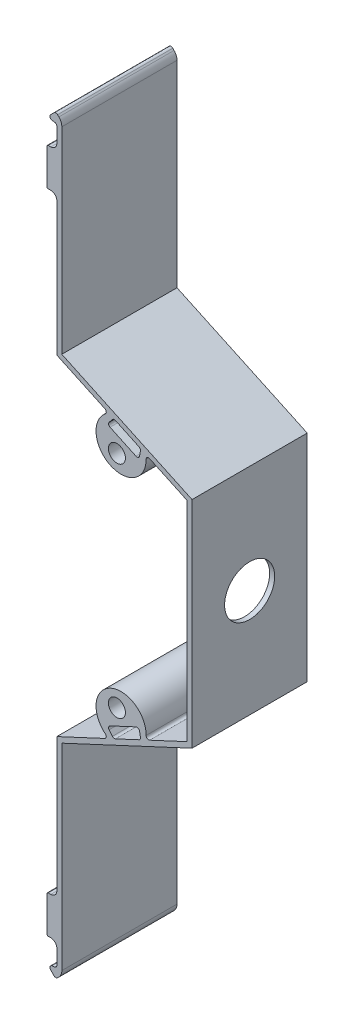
ISO-10303-21;
HEADER;
FILE_DESCRIPTION(('STEP AP214'),'2;1');
FILE_NAME('part.step','',(''),(''),'','','');
FILE_SCHEMA(('AUTOMOTIVE_DESIGN { 1 0 10303 214 1 1 1 1 }'));
ENDSEC;
DATA;
#1=APPLICATION_CONTEXT('core data for automotive mechanical design processes');
#2=APPLICATION_PROTOCOL_DEFINITION('international standard','automotive_design',2000,#1);
#3=PRODUCT_CONTEXT('',#1,'mechanical');
#4=PRODUCT('Part','Part','',(#3));
#5=PRODUCT_RELATED_PRODUCT_CATEGORY('part','',(#4));
#6=PRODUCT_DEFINITION_FORMATION('','',#4);
#7=PRODUCT_DEFINITION_CONTEXT('part definition',#1,'design');
#8=PRODUCT_DEFINITION('design','',#6,#7);
#9=PRODUCT_DEFINITION_SHAPE('','',#8);
#10=(LENGTH_UNIT() NAMED_UNIT(*) SI_UNIT(.MILLI.,.METRE.));
#11=(NAMED_UNIT(*) PLANE_ANGLE_UNIT() SI_UNIT($,.RADIAN.));
#12=(NAMED_UNIT(*) SI_UNIT($,.STERADIAN.) SOLID_ANGLE_UNIT());
#13=UNCERTAINTY_MEASURE_WITH_UNIT(LENGTH_MEASURE(1.E-05),#10,'distance_accuracy_value','');
#14=(GEOMETRIC_REPRESENTATION_CONTEXT(3) GLOBAL_UNCERTAINTY_ASSIGNED_CONTEXT((#13)) GLOBAL_UNIT_ASSIGNED_CONTEXT((#10,
#11,#12)) REPRESENTATION_CONTEXT('',''));
#15=CARTESIAN_POINT('',(0.,0.,0.));
#16=DIRECTION('',(0.,0.,1.));
#17=DIRECTION('',(1.,0.,0.));
#18=AXIS2_PLACEMENT_3D('',#15,#16,#17);
#19=CARTESIAN_POINT('',(94.,-2.63820013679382E-13,175.220069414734));
#20=DIRECTION('',(-1.,0.,0.));
#21=DIRECTION('',(0.,-1.,0.));
#22=AXIS2_PLACEMENT_3D('',#19,#20,#21);
#23=PLANE('',#22);
#24=DIRECTION('',(0.,1.,0.));
#25=VECTOR('',#24,1.);
#26=CARTESIAN_POINT('',(94.,-2.63820013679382E-13,0.));
#27=LINE('',#26,#25);
#28=CARTESIAN_POINT('',(94.0000000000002,69.5796236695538,0.));
#29=VERTEX_POINT('',#28);
#30=CARTESIAN_POINT('',(94.0000000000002,72.5445662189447,0.));
#31=VERTEX_POINT('',#30);
#32=EDGE_CURVE('E594',#29,#31,#27,.T.);
#33=ORIENTED_EDGE('',*,*,#32,.F.);
#34=DIRECTION('',(0.,0.,1.));
#35=VECTOR('',#34,1.);
#36=CARTESIAN_POINT('',(94.0000000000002,69.5796236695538,23.));
#37=LINE('',#36,#35);
#38=CARTESIAN_POINT('',(94.0000000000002,69.5796236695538,23.));
#39=VERTEX_POINT('',#38);
#40=EDGE_CURVE('E921',#29,#39,#37,.T.);
#41=ORIENTED_EDGE('',*,*,#40,.T.);
#42=DIRECTION('',(0.,1.,0.));
#43=VECTOR('',#42,1.);
#44=CARTESIAN_POINT('',(94.,-2.63820013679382E-13,23.));
#45=LINE('',#44,#43);
#46=CARTESIAN_POINT('',(94.0000000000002,72.5445662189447,23.));
#47=VERTEX_POINT('',#46);
#48=EDGE_CURVE('E1099',#39,#47,#45,.T.);
#49=ORIENTED_EDGE('',*,*,#48,.T.);
#50=DIRECTION('',(0.,0.,-1.));
#51=VECTOR('',#50,1.);
#52=CARTESIAN_POINT('',(94.0000000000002,72.5445662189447,175.220069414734));
#53=LINE('',#52,#51);
#54=EDGE_CURVE('E643',#47,#31,#53,.T.);
#55=ORIENTED_EDGE('',*,*,#54,.T.);
#56=EDGE_LOOP('',(#33,#41,#49,#55));
#57=FACE_BOUND('',#56,.T.);
#58=ADVANCED_FACE('F52',(#57),#23,.T.);
#59=CARTESIAN_POINT('',(94.,0.,175.220069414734));
#60=DIRECTION('',(1.,0.,0.));
#61=DIRECTION('',(0.,1.,0.));
#62=AXIS2_PLACEMENT_3D('',#59,#60,#61);
#63=PLANE('',#62);
#64=DIRECTION('',(0.,-1.,0.));
#65=VECTOR('',#64,1.);
#66=CARTESIAN_POINT('',(94.,0.,0.));
#67=LINE('',#66,#65);
#68=CARTESIAN_POINT('',(94.,-32.9869288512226,0.));
#69=VERTEX_POINT('',#68);
#70=CARTESIAN_POINT('',(94.,-59.6796236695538,0.));
#71=VERTEX_POINT('',#70);
#72=EDGE_CURVE('E514',#69,#71,#67,.T.);
#73=ORIENTED_EDGE('',*,*,#72,.T.);
#74=DIRECTION('',(0.,0.,-1.));
#75=VECTOR('',#74,1.);
#76=CARTESIAN_POINT('',(94.,-59.6796236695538,23.));
#77=LINE('',#76,#75);
#78=CARTESIAN_POINT('',(94.,-59.6796236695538,23.));
#79=VERTEX_POINT('',#78);
#80=EDGE_CURVE('E863',#71,#79,#77,.F.);
#81=ORIENTED_EDGE('',*,*,#80,.T.);
#82=DIRECTION('',(0.,-1.,0.));
#83=VECTOR('',#82,1.);
#84=CARTESIAN_POINT('',(94.,0.,23.));
#85=LINE('',#84,#83);
#86=CARTESIAN_POINT('',(94.,-32.9869288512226,23.));
#87=VERTEX_POINT('',#86);
#88=EDGE_CURVE('E1138',#87,#79,#85,.T.);
#89=ORIENTED_EDGE('',*,*,#88,.F.);
#90=DIRECTION('',(0.,0.,-1.));
#91=VECTOR('',#90,1.);
#92=CARTESIAN_POINT('',(94.,-32.9869288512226,175.220069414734));
#93=LINE('',#92,#91);
#94=EDGE_CURVE('E705',#87,#69,#93,.T.);
#95=ORIENTED_EDGE('',*,*,#94,.T.);
#96=EDGE_LOOP('',(#73,#81,#89,#95));
#97=FACE_BOUND('',#96,.T.);
#98=ADVANCED_FACE('F1488',(#97),#63,.F.);
#99=CARTESIAN_POINT('',(94.,-69.5796236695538,23.));
#100=VERTEX_POINT('',#99);
#101=CARTESIAN_POINT('',(94.,-72.5445662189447,23.));
#102=VERTEX_POINT('',#101);
#103=EDGE_CURVE('E1142',#100,#102,#85,.T.);
#104=ORIENTED_EDGE('',*,*,#103,.F.);
#105=DIRECTION('',(0.,0.,1.));
#106=VECTOR('',#105,1.);
#107=CARTESIAN_POINT('',(94.,-69.5796236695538,0.));
#108=LINE('',#107,#106);
#109=CARTESIAN_POINT('',(94.,-69.5796236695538,0.));
#110=VERTEX_POINT('',#109);
#111=EDGE_CURVE('E870',#100,#110,#108,.F.);
#112=ORIENTED_EDGE('',*,*,#111,.T.);
#113=CARTESIAN_POINT('',(94.,-72.5445662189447,0.));
#114=VERTEX_POINT('',#113);
#115=EDGE_CURVE('E513',#110,#114,#67,.T.);
#116=ORIENTED_EDGE('',*,*,#115,.T.);
#117=DIRECTION('',(0.,0.,-1.));
#118=VECTOR('',#117,1.);
#119=CARTESIAN_POINT('',(94.,-72.5445662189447,175.220069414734));
#120=LINE('',#119,#118);
#121=EDGE_CURVE('E701',#102,#114,#120,.T.);
#122=ORIENTED_EDGE('',*,*,#121,.F.);
#123=EDGE_LOOP('',(#104,#112,#116,#122));
#124=FACE_BOUND('',#123,.T.);
#125=ADVANCED_FACE('F1441',(#124),#63,.F.);
#126=CARTESIAN_POINT('',(0.,0.,0.));
#127=DIRECTION('',(0.,0.,1.));
#128=DIRECTION('',(1.,0.,0.));
#129=AXIS2_PLACEMENT_3D('',#126,#127,#128);
#130=PLANE('',#129);
#131=CARTESIAN_POINT('',(106.,-22.,0.));
#132=DIRECTION('',(0.,0.,1.));
#133=DIRECTION('',(1.,0.,0.));
#134=AXIS2_PLACEMENT_3D('',#131,#132,#133);
#135=CIRCLE('',#134,1.7);
#136=CARTESIAN_POINT('',(104.3,-22.,0.));
#137=VERTEX_POINT('',#136);
#138=EDGE_CURVE('E622',#137,#137,#135,.T.);
#139=ORIENTED_EDGE('',*,*,#138,.T.);
#140=EDGE_LOOP('',(#139));
#141=FACE_BOUND('',#140,.T.);
#142=CARTESIAN_POINT('',(106.,22.,0.));
#143=DIRECTION('',(0.,0.,1.));
#144=DIRECTION('',(1.,0.,0.));
#145=AXIS2_PLACEMENT_3D('',#142,#143,#144);
#146=CIRCLE('',#145,1.7);
#147=CARTESIAN_POINT('',(104.3,22.,0.));
#148=VERTEX_POINT('',#147);
#149=EDGE_CURVE('E618',#148,#148,#146,.T.);
#150=ORIENTED_EDGE('',*,*,#149,.T.);
#151=EDGE_LOOP('',(#150));
#152=FACE_BOUND('',#151,.T.);
#153=DIRECTION('',(0.,1.,0.));
#154=VECTOR('',#153,1.);
#155=CARTESIAN_POINT('',(92.,68.3796236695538,0.));
#156=LINE('',#155,#154);
#157=CARTESIAN_POINT('',(92.,61.1796236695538,0.));
#158=VERTEX_POINT('',#157);
#159=CARTESIAN_POINT('',(92.,68.0796236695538,0.));
#160=VERTEX_POINT('',#159);
#161=EDGE_CURVE('E965',#158,#160,#156,.T.);
#162=ORIENTED_EDGE('',*,*,#161,.T.);
#163=CARTESIAN_POINT('',(92.3,68.0796236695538,0.));
#164=DIRECTION('',(0.,0.,1.));
#165=DIRECTION('',(1.,0.,0.));
#166=AXIS2_PLACEMENT_3D('',#163,#164,#165);
#167=CIRCLE('',#166,0.3);
#168=CARTESIAN_POINT('',(92.3,68.3796236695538,0.));
#169=VERTEX_POINT('',#168);
#170=EDGE_CURVE('E62',#160,#169,#167,.F.);
#171=ORIENTED_EDGE('',*,*,#170,.T.);
#172=DIRECTION('',(1.,0.,0.));
#173=VECTOR('',#172,1.);
#174=CARTESIAN_POINT('',(92.,68.3796236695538,0.));
#175=LINE('',#174,#173);
#176=CARTESIAN_POINT('',(92.8000000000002,68.3796236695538,0.));
#177=VERTEX_POINT('',#176);
#178=EDGE_CURVE('E964',#169,#177,#175,.T.);
#179=ORIENTED_EDGE('',*,*,#178,.T.);
#180=CARTESIAN_POINT('',(92.8000000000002,69.5796236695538,0.));
#181=DIRECTION('',(0.,0.,1.));
#182=DIRECTION('',(1.,0.,0.));
#183=AXIS2_PLACEMENT_3D('',#180,#181,#182);
#184=CIRCLE('',#183,1.2);
#185=EDGE_CURVE('E940',#177,#29,#184,.T.);
#186=ORIENTED_EDGE('',*,*,#185,.T.);
#187=ORIENTED_EDGE('',*,*,#32,.T.);
#188=CARTESIAN_POINT('',(93.5000000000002,72.5445662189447,0.));
#189=DIRECTION('',(0.,0.,1.));
#190=DIRECTION('',(1.,0.,0.));
#191=AXIS2_PLACEMENT_3D('',#188,#189,#190);
#192=CIRCLE('',#191,0.500000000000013);
#193=CARTESIAN_POINT('',(93.5609346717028,73.0408392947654,0.));
#194=VERTEX_POINT('',#193);
#195=EDGE_CURVE('E590',#31,#194,#192,.T.);
#196=ORIENTED_EDGE('',*,*,#195,.T.);
#197=DIRECTION('',(-0.992546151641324,0.121869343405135,0.));
#198=VECTOR('',#197,1.);
#199=CARTESIAN_POINT('',(10.2246689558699,83.2732460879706,0.));
#200=LINE('',#199,#198);
#201=CARTESIAN_POINT('',(93.0646615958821,73.1017739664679,0.));
#202=VERTEX_POINT('',#201);
#203=EDGE_CURVE('E586',#194,#202,#200,.T.);
#204=ORIENTED_EDGE('',*,*,#203,.T.);
#205=CARTESIAN_POINT('',(93.1255962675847,73.5980470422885,0.));
#206=DIRECTION('',(0.,0.,1.));
#207=DIRECTION('',(1.,0.,0.));
#208=AXIS2_PLACEMENT_3D('',#205,#206,#207);
#209=CIRCLE('',#208,0.499999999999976);
#210=CARTESIAN_POINT('',(92.7720428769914,73.9516004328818,0.));
#211=VERTEX_POINT('',#210);
#212=EDGE_CURVE('E582',#202,#211,#209,.F.);
#213=ORIENTED_EDGE('',*,*,#212,.T.);
#214=DIRECTION('',(-0.707106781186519,-0.707106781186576,0.));
#215=VECTOR('',#214,1.);
#216=CARTESIAN_POINT('',(9.41022122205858,-9.41022122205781,0.));
#217=LINE('',#216,#215);
#218=CARTESIAN_POINT('',(93.4500661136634,74.6296236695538,0.));
#219=VERTEX_POINT('',#218);
#220=EDGE_CURVE('E578',#219,#211,#217,.T.);
#221=ORIENTED_EDGE('',*,*,#220,.F.);
#222=CARTESIAN_POINT('',(93.8036195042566,74.2760702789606,0.));
#223=DIRECTION('',(0.,0.,1.));
#224=DIRECTION('',(1.,0.,0.));
#225=AXIS2_PLACEMENT_3D('',#222,#223,#224);
#226=CIRCLE('',#225,0.499999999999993);
#227=CARTESIAN_POINT('',(94.1571728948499,74.6296236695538,0.));
#228=VERTEX_POINT('',#227);
#229=EDGE_CURVE('E574',#228,#219,#226,.T.);
#230=ORIENTED_EDGE('',*,*,#229,.F.);
#231=DIRECTION('',(-0.707106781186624,0.707106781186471,0.));
#232=VECTOR('',#231,1.);
#233=CARTESIAN_POINT('',(84.3933982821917,84.3933982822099,0.));
#234=LINE('',#233,#232);
#235=CARTESIAN_POINT('',(94.4142135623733,74.3725830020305,0.));
#236=VERTEX_POINT('',#235);
#237=EDGE_CURVE('E570',#236,#228,#234,.T.);
#238=ORIENTED_EDGE('',*,*,#237,.F.);
#239=CARTESIAN_POINT('',(93.0000000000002,72.9583694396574,0.));
#240=DIRECTION('',(0.,0.,1.));
#241=DIRECTION('',(1.,0.,0.));
#242=AXIS2_PLACEMENT_3D('',#239,#240,#241);
#243=CIRCLE('',#242,1.9999999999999);
#244=CARTESIAN_POINT('',(95.,72.9583694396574,0.));
#245=VERTEX_POINT('',#244);
#246=EDGE_CURVE('E566',#236,#245,#243,.F.);
#247=ORIENTED_EDGE('',*,*,#246,.T.);
#248=DIRECTION('',(0.,1.,0.));
#249=VECTOR('',#248,1.);
#250=CARTESIAN_POINT('',(95.,0.,0.));
#251=LINE('',#250,#249);
#252=CARTESIAN_POINT('',(95.,33.6239991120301,0.));
#253=VERTEX_POINT('',#252);
#254=EDGE_CURVE('E562',#253,#245,#251,.T.);
#255=ORIENTED_EDGE('',*,*,#254,.F.);
#256=DIRECTION('',(0.906307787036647,-0.422618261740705,0.));
#257=VECTOR('',#256,1.);
#258=CARTESIAN_POINT('',(29.8463273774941,64.0056556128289,0.));
#259=LINE('',#258,#257);
#260=CARTESIAN_POINT('',(121.,21.5,0.));
#261=VERTEX_POINT('',#260);
#262=EDGE_CURVE('E558',#253,#261,#259,.T.);
#263=ORIENTED_EDGE('',*,*,#262,.T.);
#264=DIRECTION('',(0.,1.,0.));
#265=VECTOR('',#264,1.);
#266=CARTESIAN_POINT('',(121.,-1.56205797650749E-13,0.));
#267=LINE('',#266,#265);
#268=CARTESIAN_POINT('',(121.,-21.5,0.));
#269=VERTEX_POINT('',#268);
#270=EDGE_CURVE('E554',#269,#261,#267,.T.);
#271=ORIENTED_EDGE('',*,*,#270,.F.);
#272=DIRECTION('',(0.906307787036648,0.422618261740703,0.));
#273=VECTOR('',#272,1.);
#274=CARTESIAN_POINT('',(29.8463273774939,-64.0056556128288,0.));
#275=LINE('',#274,#273);
#276=CARTESIAN_POINT('',(95.,-33.6239991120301,0.));
#277=VERTEX_POINT('',#276);
#278=EDGE_CURVE('E550',#277,#269,#275,.T.);
#279=ORIENTED_EDGE('',*,*,#278,.F.);
#280=DIRECTION('',(0.,1.,0.));
#281=VECTOR('',#280,1.);
#282=CARTESIAN_POINT('',(95.,0.,0.));
#283=LINE('',#282,#281);
#284=CARTESIAN_POINT('',(95.,-72.9583694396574,0.));
#285=VERTEX_POINT('',#284);
#286=EDGE_CURVE('E546',#285,#277,#283,.T.);
#287=ORIENTED_EDGE('',*,*,#286,.F.);
#288=CARTESIAN_POINT('',(93.,-72.9583694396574,0.));
#289=DIRECTION('',(0.,0.,1.));
#290=DIRECTION('',(1.,0.,0.));
#291=AXIS2_PLACEMENT_3D('',#288,#289,#290);
#292=CIRCLE('',#291,1.99999999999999);
#293=CARTESIAN_POINT('',(94.4142135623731,-74.3725830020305,0.));
#294=VERTEX_POINT('',#293);
#295=EDGE_CURVE('E542',#294,#285,#292,.T.);
#296=ORIENTED_EDGE('',*,*,#295,.F.);
#297=DIRECTION('',(-0.707106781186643,-0.707106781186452,0.));
#298=VECTOR('',#297,1.);
#299=CARTESIAN_POINT('',(84.3933982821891,-84.3933982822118,0.));
#300=LINE('',#299,#298);
#301=CARTESIAN_POINT('',(94.1571728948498,-74.6296236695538,0.));
#302=VERTEX_POINT('',#301);
#303=EDGE_CURVE('E538',#294,#302,#300,.T.);
#304=ORIENTED_EDGE('',*,*,#303,.T.);
#305=CARTESIAN_POINT('',(93.8036195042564,-74.2760702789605,0.));
#306=DIRECTION('',(0.,0.,1.));
#307=DIRECTION('',(1.,0.,0.));
#308=AXIS2_PLACEMENT_3D('',#305,#306,#307);
#309=CIRCLE('',#308,0.499999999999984);
#310=CARTESIAN_POINT('',(93.4500661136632,-74.6296236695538,0.));
#311=VERTEX_POINT('',#310);
#312=EDGE_CURVE('E534',#302,#311,#309,.F.);
#313=ORIENTED_EDGE('',*,*,#312,.T.);
#314=DIRECTION('',(-0.707106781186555,0.70710678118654,0.));
#315=VECTOR('',#314,1.);
#316=CARTESIAN_POINT('',(9.41022122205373,9.41022122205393,0.));
#317=LINE('',#316,#315);
#318=CARTESIAN_POINT('',(92.7720428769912,-73.9516004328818,0.));
#319=VERTEX_POINT('',#318);
#320=EDGE_CURVE('E530',#311,#319,#317,.T.);
#321=ORIENTED_EDGE('',*,*,#320,.T.);
#322=CARTESIAN_POINT('',(93.1255962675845,-73.5980470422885,0.));
#323=DIRECTION('',(0.,0.,1.));
#324=DIRECTION('',(1.,0.,0.));
#325=AXIS2_PLACEMENT_3D('',#322,#323,#324);
#326=CIRCLE('',#325,0.49999999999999);
#327=CARTESIAN_POINT('',(93.0646615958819,-73.1017739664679,0.));
#328=VERTEX_POINT('',#327);
#329=EDGE_CURVE('E526',#328,#319,#326,.T.);
#330=ORIENTED_EDGE('',*,*,#329,.F.);
#331=DIRECTION('',(-0.99254615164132,-0.121869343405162,0.));
#332=VECTOR('',#331,1.);
#333=CARTESIAN_POINT('',(10.2246689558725,-83.2732460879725,0.));
#334=LINE('',#333,#332);
#335=CARTESIAN_POINT('',(93.5609346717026,-73.0408392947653,0.));
#336=VERTEX_POINT('',#335);
#337=EDGE_CURVE('E522',#336,#328,#334,.T.);
#338=ORIENTED_EDGE('',*,*,#337,.F.);
#339=CARTESIAN_POINT('',(93.5,-72.5445662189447,0.));
#340=DIRECTION('',(0.,0.,1.));
#341=DIRECTION('',(1.,0.,0.));
#342=AXIS2_PLACEMENT_3D('',#339,#340,#341);
#343=CIRCLE('',#342,0.499999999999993);
#344=EDGE_CURVE('E518',#114,#336,#343,.F.);
#345=ORIENTED_EDGE('',*,*,#344,.F.);
#346=ORIENTED_EDGE('',*,*,#115,.F.);
#347=CARTESIAN_POINT('',(92.8,-69.5796236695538,0.));
#348=DIRECTION('',(0.,0.,1.));
#349=DIRECTION('',(1.,0.,0.));
#350=AXIS2_PLACEMENT_3D('',#347,#348,#349);
#351=CIRCLE('',#350,1.2);
#352=CARTESIAN_POINT('',(92.8,-68.3796236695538,0.));
#353=VERTEX_POINT('',#352);
#354=EDGE_CURVE('E883',#110,#353,#351,.T.);
#355=ORIENTED_EDGE('',*,*,#354,.T.);
#356=DIRECTION('',(1.,0.,0.));
#357=VECTOR('',#356,1.);
#358=CARTESIAN_POINT('',(92.,-68.3796236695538,0.));
#359=LINE('',#358,#357);
#360=CARTESIAN_POINT('',(92.3,-68.3796236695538,0.));
#361=VERTEX_POINT('',#360);
#362=EDGE_CURVE('E1013',#361,#353,#359,.T.);
#363=ORIENTED_EDGE('',*,*,#362,.F.);
#364=CARTESIAN_POINT('',(92.3,-68.0796236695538,0.));
#365=DIRECTION('',(0.,0.,1.));
#366=DIRECTION('',(1.,0.,0.));
#367=AXIS2_PLACEMENT_3D('',#364,#365,#366);
#368=CIRCLE('',#367,0.3);
#369=CARTESIAN_POINT('',(92.,-68.0796236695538,0.));
#370=VERTEX_POINT('',#369);
#371=EDGE_CURVE('E895',#361,#370,#368,.F.);
#372=ORIENTED_EDGE('',*,*,#371,.T.);
#373=DIRECTION('',(0.,-1.,0.));
#374=VECTOR('',#373,1.);
#375=CARTESIAN_POINT('',(92.,-68.3796236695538,0.));
#376=LINE('',#375,#374);
#377=CARTESIAN_POINT('',(92.,-61.1796236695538,0.));
#378=VERTEX_POINT('',#377);
#379=EDGE_CURVE('E1006',#378,#370,#376,.T.);
#380=ORIENTED_EDGE('',*,*,#379,.F.);
#381=CARTESIAN_POINT('',(92.3,-61.1796236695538,0.));
#382=DIRECTION('',(0.,0.,1.));
#383=DIRECTION('',(1.,0.,0.));
#384=AXIS2_PLACEMENT_3D('',#381,#382,#383);
#385=CIRCLE('',#384,0.3);
#386=CARTESIAN_POINT('',(92.3,-60.8796236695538,0.));
#387=VERTEX_POINT('',#386);
#388=EDGE_CURVE('E898',#378,#387,#385,.F.);
#389=ORIENTED_EDGE('',*,*,#388,.T.);
#390=DIRECTION('',(1.,0.,0.));
#391=VECTOR('',#390,1.);
#392=CARTESIAN_POINT('',(92.,-60.8796236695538,0.));
#393=LINE('',#392,#391);
#394=CARTESIAN_POINT('',(92.8,-60.8796236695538,0.));
#395=VERTEX_POINT('',#394);
#396=EDGE_CURVE('E1016',#387,#395,#393,.T.);
#397=ORIENTED_EDGE('',*,*,#396,.T.);
#398=CARTESIAN_POINT('',(92.8,-59.6796236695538,0.));
#399=DIRECTION('',(0.,0.,1.));
#400=DIRECTION('',(1.,0.,0.));
#401=AXIS2_PLACEMENT_3D('',#398,#399,#400);
#402=CIRCLE('',#401,1.2);
#403=EDGE_CURVE('E873',#395,#71,#402,.T.);
#404=ORIENTED_EDGE('',*,*,#403,.T.);
#405=ORIENTED_EDGE('',*,*,#72,.F.);
#406=DIRECTION('',(-0.906307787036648,-0.422618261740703,0.));
#407=VECTOR('',#406,1.);
#408=CARTESIAN_POINT('',(29.4237091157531,-63.0993478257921,0.));
#409=LINE('',#408,#407);
#410=CARTESIAN_POINT('',(103.587310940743,-28.5162923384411,0.));
#411=VERTEX_POINT('',#410);
#412=EDGE_CURVE('E509',#411,#69,#409,.T.);
#413=ORIENTED_EDGE('',*,*,#412,.F.);
#414=CARTESIAN_POINT('',(103.376001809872,-28.0631384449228,0.));
#415=DIRECTION('',(0.,0.,1.));
#416=DIRECTION('',(1.,0.,0.));
#417=AXIS2_PLACEMENT_3D('',#414,#415,#416);
#418=CIRCLE('',#417,0.499999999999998);
#419=CARTESIAN_POINT('',(103.690207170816,-27.6741975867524,0.));
#420=VERTEX_POINT('',#419);
#421=EDGE_CURVE('E505',#420,#411,#418,.F.);
#422=ORIENTED_EDGE('',*,*,#421,.F.);
#423=CARTESIAN_POINT('',(106.832260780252,-23.7847890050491,0.));
#424=DIRECTION('',(0.,0.,1.));
#425=DIRECTION('',(1.,0.,0.));
#426=AXIS2_PLACEMENT_3D('',#423,#424,#425);
#427=CIRCLE('',#426,5.);
#428=CARTESIAN_POINT('',(111.831393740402,-23.8778999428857,0.));
#429=VERTEX_POINT('',#428);
#430=EDGE_CURVE('E501',#429,#420,#427,.T.);
#431=ORIENTED_EDGE('',*,*,#430,.F.);
#432=CARTESIAN_POINT('',(112.331307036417,-23.8872110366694,0.));
#433=DIRECTION('',(0.,0.,1.));
#434=DIRECTION('',(1.,0.,0.));
#435=AXIS2_PLACEMENT_3D('',#432,#433,#434);
#436=CIRCLE('',#435,0.499999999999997);
#437=CARTESIAN_POINT('',(112.542616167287,-24.3403649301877,0.));
#438=VERTEX_POINT('',#437);
#439=EDGE_CURVE('E481',#438,#429,#436,.F.);
#440=ORIENTED_EDGE('',*,*,#439,.F.);
#441=DIRECTION('',(-0.906307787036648,-0.422618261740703,0.));
#442=VECTOR('',#441,1.);
#443=CARTESIAN_POINT('',(29.4237091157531,-63.0993478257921,0.));
#444=LINE('',#443,#442);
#445=CARTESIAN_POINT('',(120.,-20.8629297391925,0.));
#446=VERTEX_POINT('',#445);
#447=EDGE_CURVE('E462',#446,#438,#444,.T.);
#448=ORIENTED_EDGE('',*,*,#447,.F.);
#449=DIRECTION('',(0.,1.,0.));
#450=VECTOR('',#449,1.);
#451=CARTESIAN_POINT('',(120.,-1.59645319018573E-13,0.));
#452=LINE('',#451,#450);
#453=CARTESIAN_POINT('',(120.,20.8629297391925,0.));
#454=VERTEX_POINT('',#453);
#455=EDGE_CURVE('E477',#446,#454,#452,.T.);
#456=ORIENTED_EDGE('',*,*,#455,.T.);
#457=DIRECTION('',(-0.906307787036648,0.422618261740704,0.));
#458=VECTOR('',#457,1.);
#459=CARTESIAN_POINT('',(29.4237091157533,63.0993478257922,0.));
#460=LINE('',#459,#458);
#461=CARTESIAN_POINT('',(112.542616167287,24.3403649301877,0.));
#462=VERTEX_POINT('',#461);
#463=EDGE_CURVE('E615',#454,#462,#460,.T.);
#464=ORIENTED_EDGE('',*,*,#463,.T.);
#465=CARTESIAN_POINT('',(112.331307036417,23.8872110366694,0.));
#466=DIRECTION('',(0.,0.,1.));
#467=DIRECTION('',(1.,0.,0.));
#468=AXIS2_PLACEMENT_3D('',#465,#466,#467);
#469=CIRCLE('',#468,0.499999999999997);
#470=CARTESIAN_POINT('',(111.831393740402,23.8778999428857,0.));
#471=VERTEX_POINT('',#470);
#472=EDGE_CURVE('E611',#471,#462,#469,.F.);
#473=ORIENTED_EDGE('',*,*,#472,.F.);
#474=CARTESIAN_POINT('',(106.832260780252,23.7847890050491,0.));
#475=DIRECTION('',(0.,0.,1.));
#476=DIRECTION('',(1.,0.,0.));
#477=AXIS2_PLACEMENT_3D('',#474,#475,#476);
#478=CIRCLE('',#477,4.99999999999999);
#479=CARTESIAN_POINT('',(103.690207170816,27.6741975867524,0.));
#480=VERTEX_POINT('',#479);
#481=EDGE_CURVE('E607',#471,#480,#478,.F.);
#482=ORIENTED_EDGE('',*,*,#481,.T.);
#483=CARTESIAN_POINT('',(103.376001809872,28.0631384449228,0.));
#484=DIRECTION('',(0.,0.,1.));
#485=DIRECTION('',(1.,0.,0.));
#486=AXIS2_PLACEMENT_3D('',#483,#484,#485);
#487=CIRCLE('',#486,0.499999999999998);
#488=CARTESIAN_POINT('',(103.587310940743,28.5162923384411,0.));
#489=VERTEX_POINT('',#488);
#490=EDGE_CURVE('E603',#480,#489,#487,.T.);
#491=ORIENTED_EDGE('',*,*,#490,.T.);
#492=DIRECTION('',(-0.906307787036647,0.422618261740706,0.));
#493=VECTOR('',#492,1.);
#494=CARTESIAN_POINT('',(29.4237091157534,63.0993478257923,0.));
#495=LINE('',#494,#493);
#496=CARTESIAN_POINT('',(94.0000000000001,32.9869288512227,0.));
#497=VERTEX_POINT('',#496);
#498=EDGE_CURVE('E599',#489,#497,#495,.T.);
#499=ORIENTED_EDGE('',*,*,#498,.T.);
#500=CARTESIAN_POINT('',(94.0000000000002,59.6796236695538,0.));
#501=VERTEX_POINT('',#500);
#502=EDGE_CURVE('E595',#497,#501,#27,.T.);
#503=ORIENTED_EDGE('',*,*,#502,.T.);
#504=CARTESIAN_POINT('',(92.8000000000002,59.6796236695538,0.));
#505=DIRECTION('',(0.,0.,1.));
#506=DIRECTION('',(1.,0.,0.));
#507=AXIS2_PLACEMENT_3D('',#504,#505,#506);
#508=CIRCLE('',#507,1.2);
#509=CARTESIAN_POINT('',(92.8000000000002,60.8796236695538,0.));
#510=VERTEX_POINT('',#509);
#511=EDGE_CURVE('E929',#501,#510,#508,.T.);
#512=ORIENTED_EDGE('',*,*,#511,.T.);
#513=DIRECTION('',(1.,0.,0.));
#514=VECTOR('',#513,1.);
#515=CARTESIAN_POINT('',(92.,60.8796236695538,0.));
#516=LINE('',#515,#514);
#517=CARTESIAN_POINT('',(92.3,60.8796236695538,0.));
#518=VERTEX_POINT('',#517);
#519=EDGE_CURVE('E975',#518,#510,#516,.T.);
#520=ORIENTED_EDGE('',*,*,#519,.F.);
#521=CARTESIAN_POINT('',(92.3,61.1796236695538,0.));
#522=DIRECTION('',(0.,0.,1.));
#523=DIRECTION('',(1.,0.,0.));
#524=AXIS2_PLACEMENT_3D('',#521,#522,#523);
#525=CIRCLE('',#524,0.3);
#526=EDGE_CURVE('E69',#518,#158,#525,.F.);
#527=ORIENTED_EDGE('',*,*,#526,.T.);
#528=EDGE_LOOP('',(#162,#171,#179,#186,#187,#196,#204,#213,#221,#230,#238,#247,#255,#263,#271,
#279,#287,#296,#304,#313,#321,#330,#338,#345,#346,#355,#363,#372,#380,#389,#397,#404,#405,#413,
#422,#431,#440,#448,#456,#464,#473,#482,#491,#499,#503,#512,#520,#527));
#529=FACE_BOUND('',#528,.T.);
#530=DIRECTION('',(0.906307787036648,-0.422618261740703,0.));
#531=VECTOR('',#530,1.);
#532=CARTESIAN_POINT('',(105.346040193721,27.6961834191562,0.));
#533=LINE('',#532,#531);
#534=CARTESIAN_POINT('',(105.69985206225,27.5311982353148,0.));
#535=VERTEX_POINT('',#534);
#536=CARTESIAN_POINT('',(110.430075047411,25.3254590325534,0.));
#537=VERTEX_POINT('',#536);
#538=EDGE_CURVE('E1059',#535,#537,#533,.T.);
#539=ORIENTED_EDGE('',*,*,#538,.F.);
#540=CARTESIAN_POINT('',(105.48854293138,27.0780443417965,0.));
#541=DIRECTION('',(0.,0.,1.));
#542=DIRECTION('',(1.,0.,0.));
#543=AXIS2_PLACEMENT_3D('',#540,#541,#542);
#544=CIRCLE('',#543,0.5);
#545=CARTESIAN_POINT('',(105.100169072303,27.3929502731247,0.));
#546=VERTEX_POINT('',#545);
#547=EDGE_CURVE('E792',#535,#546,#544,.T.);
#548=ORIENTED_EDGE('',*,*,#547,.T.);
#549=DIRECTION('',(0.629811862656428,0.776747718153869,0.));
#550=VECTOR('',#549,1.);
#551=CARTESIAN_POINT('',(105.346040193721,27.6961834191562,0.));
#552=LINE('',#551,#550);
#553=CARTESIAN_POINT('',(104.450973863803,26.5922970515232,0.));
#554=VERTEX_POINT('',#553);
#555=EDGE_CURVE('E493',#554,#546,#552,.T.);
#556=ORIENTED_EDGE('',*,*,#555,.F.);
#557=CARTESIAN_POINT('',(104.83934772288,26.277391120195,0.));
#558=DIRECTION('',(0.,0.,1.));
#559=DIRECTION('',(1.,0.,0.));
#560=AXIS2_PLACEMENT_3D('',#557,#558,#559);
#561=CIRCLE('',#560,0.5);
#562=CARTESIAN_POINT('',(104.628038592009,25.8242372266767,0.));
#563=VERTEX_POINT('',#562);
#564=EDGE_CURVE('E786',#554,#563,#561,.T.);
#565=ORIENTED_EDGE('',*,*,#564,.T.);
#566=DIRECTION('',(-0.906307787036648,0.422618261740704,0.));
#567=VECTOR('',#566,1.);
#568=CARTESIAN_POINT('',(104.047649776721,26.0948769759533,0.));
#569=LINE('',#568,#567);
#570=CARTESIAN_POINT('',(109.811415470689,23.4071888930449,0.));
#571=VERTEX_POINT('',#570);
#572=EDGE_CURVE('E488',#571,#563,#569,.T.);
#573=ORIENTED_EDGE('',*,*,#572,.F.);
#574=CARTESIAN_POINT('',(110.022724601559,23.8603427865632,0.));
#575=DIRECTION('',(0.,0.,1.));
#576=DIRECTION('',(1.,0.,0.));
#577=AXIS2_PLACEMENT_3D('',#574,#575,#576);
#578=CIRCLE('',#577,0.5);
#579=CARTESIAN_POINT('',(110.513598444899,23.7652487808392,0.));
#580=VERTEX_POINT('',#579);
#581=EDGE_CURVE('E804',#571,#580,#578,.T.);
#582=ORIENTED_EDGE('',*,*,#581,.T.);
#583=DIRECTION('',(-0.190188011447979,-0.981747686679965,0.));
#584=VECTOR('',#583,1.);
#585=CARTESIAN_POINT('',(110.78388691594,25.160473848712,0.));
#586=LINE('',#585,#584);
#587=CARTESIAN_POINT('',(110.709639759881,24.7772111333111,0.));
#588=VERTEX_POINT('',#587);
#589=EDGE_CURVE('E1055',#588,#580,#586,.T.);
#590=ORIENTED_EDGE('',*,*,#589,.F.);
#591=CARTESIAN_POINT('',(110.218765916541,24.872305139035,0.));
#592=DIRECTION('',(0.,0.,1.));
#593=DIRECTION('',(1.,0.,0.));
#594=AXIS2_PLACEMENT_3D('',#591,#592,#593);
#595=CIRCLE('',#594,0.5);
#596=EDGE_CURVE('E798',#588,#537,#595,.T.);
#597=ORIENTED_EDGE('',*,*,#596,.T.);
#598=EDGE_LOOP('',(#539,#548,#556,#565,#573,#582,#590,#597));
#599=FACE_BOUND('',#598,.T.);
#600=DIRECTION('',(0.629811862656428,-0.776747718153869,0.));
#601=VECTOR('',#600,1.);
#602=CARTESIAN_POINT('',(105.346040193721,-27.6961834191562,0.));
#603=LINE('',#602,#601);
#604=CARTESIAN_POINT('',(104.450973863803,-26.5922970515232,0.));
#605=VERTEX_POINT('',#604);
#606=CARTESIAN_POINT('',(105.100169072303,-27.3929502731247,0.));
#607=VERTEX_POINT('',#606);
#608=EDGE_CURVE('E1032',#605,#607,#603,.T.);
#609=ORIENTED_EDGE('',*,*,#608,.T.);
#610=CARTESIAN_POINT('',(105.48854293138,-27.0780443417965,0.));
#611=DIRECTION('',(0.,0.,1.));
#612=DIRECTION('',(1.,0.,0.));
#613=AXIS2_PLACEMENT_3D('',#610,#611,#612);
#614=CIRCLE('',#613,0.5);
#615=CARTESIAN_POINT('',(105.69985206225,-27.5311982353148,0.));
#616=VERTEX_POINT('',#615);
#617=EDGE_CURVE('E844',#607,#616,#614,.T.);
#618=ORIENTED_EDGE('',*,*,#617,.T.);
#619=DIRECTION('',(0.906307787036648,0.422618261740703,0.));
#620=VECTOR('',#619,1.);
#621=CARTESIAN_POINT('',(105.346040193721,-27.6961834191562,0.));
#622=LINE('',#621,#620);
#623=CARTESIAN_POINT('',(110.430075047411,-25.3254590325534,0.));
#624=VERTEX_POINT('',#623);
#625=EDGE_CURVE('E1028',#616,#624,#622,.T.);
#626=ORIENTED_EDGE('',*,*,#625,.T.);
#627=CARTESIAN_POINT('',(110.218765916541,-24.872305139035,0.));
#628=DIRECTION('',(0.,0.,1.));
#629=DIRECTION('',(1.,0.,0.));
#630=AXIS2_PLACEMENT_3D('',#627,#628,#629);
#631=CIRCLE('',#630,0.5);
#632=CARTESIAN_POINT('',(110.709639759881,-24.7772111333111,0.));
#633=VERTEX_POINT('',#632);
#634=EDGE_CURVE('E850',#624,#633,#631,.T.);
#635=ORIENTED_EDGE('',*,*,#634,.T.);
#636=DIRECTION('',(-0.190188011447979,0.981747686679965,0.));
#637=VECTOR('',#636,1.);
#638=CARTESIAN_POINT('',(110.78388691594,-25.160473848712,0.));
#639=LINE('',#638,#637);
#640=CARTESIAN_POINT('',(110.513598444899,-23.7652487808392,0.));
#641=VERTEX_POINT('',#640);
#642=EDGE_CURVE('E1023',#633,#641,#639,.T.);
#643=ORIENTED_EDGE('',*,*,#642,.T.);
#644=CARTESIAN_POINT('',(110.022724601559,-23.8603427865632,0.));
#645=DIRECTION('',(0.,0.,1.));
#646=DIRECTION('',(1.,0.,0.));
#647=AXIS2_PLACEMENT_3D('',#644,#645,#646);
#648=CIRCLE('',#647,0.5);
#649=CARTESIAN_POINT('',(109.811415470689,-23.4071888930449,0.));
#650=VERTEX_POINT('',#649);
#651=EDGE_CURVE('E856',#641,#650,#648,.T.);
#652=ORIENTED_EDGE('',*,*,#651,.T.);
#653=DIRECTION('',(-0.906307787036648,-0.422618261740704,0.));
#654=VECTOR('',#653,1.);
#655=CARTESIAN_POINT('',(104.047649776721,-26.0948769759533,0.));
#656=LINE('',#655,#654);
#657=CARTESIAN_POINT('',(104.628038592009,-25.8242372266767,0.));
#658=VERTEX_POINT('',#657);
#659=EDGE_CURVE('E1027',#650,#658,#656,.T.);
#660=ORIENTED_EDGE('',*,*,#659,.T.);
#661=CARTESIAN_POINT('',(104.83934772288,-26.277391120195,0.));
#662=DIRECTION('',(0.,0.,1.));
#663=DIRECTION('',(1.,0.,0.));
#664=AXIS2_PLACEMENT_3D('',#661,#662,#663);
#665=CIRCLE('',#664,0.5);
#666=EDGE_CURVE('E838',#658,#605,#665,.T.);
#667=ORIENTED_EDGE('',*,*,#666,.T.);
#668=EDGE_LOOP('',(#609,#618,#626,#635,#643,#652,#660,#667));
#669=FACE_BOUND('',#668,.T.);
#670=ADVANCED_FACE('F474',(#141,#152,#529,#599,#669),#130,.F.);
#671=CARTESIAN_POINT('',(0.,0.,23.));
#672=DIRECTION('',(0.,0.,1.));
#673=DIRECTION('',(0.,-1.,0.));
#674=AXIS2_PLACEMENT_3D('',#671,#672,#673);
#675=PLANE('',#674);
#676=DIRECTION('',(-0.629811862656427,-0.776747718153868,0.));
#677=VECTOR('',#676,1.);
#678=CARTESIAN_POINT('',(105.346040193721,27.6961834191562,23.));
#679=LINE('',#678,#677);
#680=CARTESIAN_POINT('',(105.100169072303,27.3929502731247,23.));
#681=VERTEX_POINT('',#680);
#682=CARTESIAN_POINT('',(104.450973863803,26.5922970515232,23.));
#683=VERTEX_POINT('',#682);
#684=EDGE_CURVE('E1036',#681,#683,#679,.T.);
#685=ORIENTED_EDGE('',*,*,#684,.F.);
#686=CARTESIAN_POINT('',(105.48854293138,27.0780443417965,23.));
#687=DIRECTION('',(0.,0.,1.));
#688=DIRECTION('',(1.,0.,0.));
#689=AXIS2_PLACEMENT_3D('',#686,#687,#688);
#690=CIRCLE('',#689,0.5);
#691=CARTESIAN_POINT('',(105.69985206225,27.5311982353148,23.));
#692=VERTEX_POINT('',#691);
#693=EDGE_CURVE('E789',#681,#692,#690,.F.);
#694=ORIENTED_EDGE('',*,*,#693,.T.);
#695=DIRECTION('',(-0.906307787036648,0.422618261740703,0.));
#696=VECTOR('',#695,1.);
#697=CARTESIAN_POINT('',(105.346040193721,27.6961834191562,23.));
#698=LINE('',#697,#696);
#699=CARTESIAN_POINT('',(110.430075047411,25.3254590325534,23.));
#700=VERTEX_POINT('',#699);
#701=EDGE_CURVE('E1060',#700,#692,#698,.T.);
#702=ORIENTED_EDGE('',*,*,#701,.F.);
#703=CARTESIAN_POINT('',(110.218765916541,24.872305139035,23.));
#704=DIRECTION('',(0.,0.,1.));
#705=DIRECTION('',(1.,0.,0.));
#706=AXIS2_PLACEMENT_3D('',#703,#704,#705);
#707=CIRCLE('',#706,0.5);
#708=CARTESIAN_POINT('',(110.709639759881,24.7772111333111,23.));
#709=VERTEX_POINT('',#708);
#710=EDGE_CURVE('E795',#700,#709,#707,.F.);
#711=ORIENTED_EDGE('',*,*,#710,.T.);
#712=DIRECTION('',(0.190188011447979,0.981747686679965,0.));
#713=VECTOR('',#712,1.);
#714=CARTESIAN_POINT('',(110.78388691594,25.160473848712,23.));
#715=LINE('',#714,#713);
#716=CARTESIAN_POINT('',(110.513598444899,23.7652487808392,23.));
#717=VERTEX_POINT('',#716);
#718=EDGE_CURVE('E1074',#717,#709,#715,.T.);
#719=ORIENTED_EDGE('',*,*,#718,.F.);
#720=CARTESIAN_POINT('',(110.022724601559,23.8603427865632,23.));
#721=DIRECTION('',(0.,0.,1.));
#722=DIRECTION('',(1.,0.,0.));
#723=AXIS2_PLACEMENT_3D('',#720,#721,#722);
#724=CIRCLE('',#723,0.5);
#725=CARTESIAN_POINT('',(109.811415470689,23.4071888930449,23.));
#726=VERTEX_POINT('',#725);
#727=EDGE_CURVE('E801',#717,#726,#724,.F.);
#728=ORIENTED_EDGE('',*,*,#727,.T.);
#729=DIRECTION('',(0.906307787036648,-0.422618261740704,0.));
#730=VECTOR('',#729,1.);
#731=CARTESIAN_POINT('',(104.047649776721,26.0948769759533,23.));
#732=LINE('',#731,#730);
#733=CARTESIAN_POINT('',(104.628038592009,25.8242372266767,23.));
#734=VERTEX_POINT('',#733);
#735=EDGE_CURVE('E1070',#734,#726,#732,.T.);
#736=ORIENTED_EDGE('',*,*,#735,.F.);
#737=CARTESIAN_POINT('',(104.83934772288,26.277391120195,23.));
#738=DIRECTION('',(0.,0.,1.));
#739=DIRECTION('',(1.,0.,0.));
#740=AXIS2_PLACEMENT_3D('',#737,#738,#739);
#741=CIRCLE('',#740,0.5);
#742=EDGE_CURVE('E783',#734,#683,#741,.F.);
#743=ORIENTED_EDGE('',*,*,#742,.T.);
#744=EDGE_LOOP('',(#685,#694,#702,#711,#719,#728,#736,#743));
#745=FACE_BOUND('',#744,.T.);
#746=CARTESIAN_POINT('',(106.,22.,23.));
#747=DIRECTION('',(0.,0.,1.));
#748=DIRECTION('',(1.,0.,0.));
#749=AXIS2_PLACEMENT_3D('',#746,#747,#748);
#750=CIRCLE('',#749,1.7);
#751=CARTESIAN_POINT('',(104.3,22.,23.));
#752=VERTEX_POINT('',#751);
#753=EDGE_CURVE('E496',#752,#752,#750,.T.);
#754=ORIENTED_EDGE('',*,*,#753,.F.);
#755=EDGE_LOOP('',(#754));
#756=FACE_BOUND('',#755,.T.);
#757=CARTESIAN_POINT('',(106.,-22.,23.));
#758=DIRECTION('',(0.,0.,1.));
#759=DIRECTION('',(1.,0.,0.));
#760=AXIS2_PLACEMENT_3D('',#757,#758,#759);
#761=CIRCLE('',#760,1.7);
#762=CARTESIAN_POINT('',(104.3,-22.,23.));
#763=VERTEX_POINT('',#762);
#764=EDGE_CURVE('E719',#763,#763,#761,.T.);
#765=ORIENTED_EDGE('',*,*,#764,.F.);
#766=EDGE_LOOP('',(#765));
#767=FACE_BOUND('',#766,.T.);
#768=DIRECTION('',(1.,0.,0.));
#769=VECTOR('',#768,1.);
#770=CARTESIAN_POINT('',(92.,68.3796236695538,23.));
#771=LINE('',#770,#769);
#772=CARTESIAN_POINT('',(92.3,68.3796236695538,23.));
#773=VERTEX_POINT('',#772);
#774=CARTESIAN_POINT('',(92.8000000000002,68.3796236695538,23.));
#775=VERTEX_POINT('',#774);
#776=EDGE_CURVE('E974',#773,#775,#771,.T.);
#777=ORIENTED_EDGE('',*,*,#776,.F.);
#778=CARTESIAN_POINT('',(92.3,68.0796236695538,23.));
#779=DIRECTION('',(0.,0.,1.));
#780=DIRECTION('',(1.,0.,0.));
#781=AXIS2_PLACEMENT_3D('',#778,#779,#780);
#782=CIRCLE('',#781,0.3);
#783=CARTESIAN_POINT('',(92.,68.0796236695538,23.));
#784=VERTEX_POINT('',#783);
#785=EDGE_CURVE('E950',#773,#784,#782,.T.);
#786=ORIENTED_EDGE('',*,*,#785,.T.);
#787=DIRECTION('',(0.,-1.,0.));
#788=VECTOR('',#787,1.);
#789=CARTESIAN_POINT('',(92.,68.3796236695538,23.));
#790=LINE('',#789,#788);
#791=CARTESIAN_POINT('',(92.,61.1796236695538,23.));
#792=VERTEX_POINT('',#791);
#793=EDGE_CURVE('E982',#784,#792,#790,.T.);
#794=ORIENTED_EDGE('',*,*,#793,.T.);
#795=CARTESIAN_POINT('',(92.3,61.1796236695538,23.));
#796=DIRECTION('',(0.,0.,1.));
#797=DIRECTION('',(1.,0.,0.));
#798=AXIS2_PLACEMENT_3D('',#795,#796,#797);
#799=CIRCLE('',#798,0.3);
#800=CARTESIAN_POINT('',(92.3,60.8796236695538,23.));
#801=VERTEX_POINT('',#800);
#802=EDGE_CURVE('E947',#792,#801,#799,.T.);
#803=ORIENTED_EDGE('',*,*,#802,.T.);
#804=DIRECTION('',(1.,0.,0.));
#805=VECTOR('',#804,1.);
#806=CARTESIAN_POINT('',(92.,60.8796236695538,23.));
#807=LINE('',#806,#805);
#808=CARTESIAN_POINT('',(92.8000000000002,60.8796236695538,23.));
#809=VERTEX_POINT('',#808);
#810=EDGE_CURVE('E990',#801,#809,#807,.T.);
#811=ORIENTED_EDGE('',*,*,#810,.T.);
#812=CARTESIAN_POINT('',(92.8000000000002,59.6796236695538,23.));
#813=DIRECTION('',(0.,0.,1.));
#814=DIRECTION('',(1.,0.,0.));
#815=AXIS2_PLACEMENT_3D('',#812,#813,#814);
#816=CIRCLE('',#815,1.2);
#817=CARTESIAN_POINT('',(94.0000000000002,59.6796236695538,23.));
#818=VERTEX_POINT('',#817);
#819=EDGE_CURVE('E933',#809,#818,#816,.F.);
#820=ORIENTED_EDGE('',*,*,#819,.T.);
#821=CARTESIAN_POINT('',(94.0000000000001,32.9869288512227,23.));
#822=VERTEX_POINT('',#821);
#823=EDGE_CURVE('E1100',#822,#818,#45,.T.);
#824=ORIENTED_EDGE('',*,*,#823,.F.);
#825=DIRECTION('',(-0.906307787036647,0.422618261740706,0.));
#826=VECTOR('',#825,1.);
#827=CARTESIAN_POINT('',(29.4237091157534,63.0993478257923,23.));
#828=LINE('',#827,#826);
#829=CARTESIAN_POINT('',(103.587310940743,28.5162923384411,23.));
#830=VERTEX_POINT('',#829);
#831=EDGE_CURVE('E1095',#830,#822,#828,.T.);
#832=ORIENTED_EDGE('',*,*,#831,.F.);
#833=CARTESIAN_POINT('',(103.376001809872,28.0631384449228,23.));
#834=DIRECTION('',(0.,0.,1.));
#835=DIRECTION('',(1.,0.,0.));
#836=AXIS2_PLACEMENT_3D('',#833,#834,#835);
#837=CIRCLE('',#836,0.499999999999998);
#838=CARTESIAN_POINT('',(103.690207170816,27.6741975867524,23.));
#839=VERTEX_POINT('',#838);
#840=EDGE_CURVE('E1091',#839,#830,#837,.T.);
#841=ORIENTED_EDGE('',*,*,#840,.F.);
#842=CARTESIAN_POINT('',(106.832260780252,23.7847890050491,23.));
#843=DIRECTION('',(0.,0.,1.));
#844=DIRECTION('',(1.,0.,0.));
#845=AXIS2_PLACEMENT_3D('',#842,#843,#844);
#846=CIRCLE('',#845,4.99999999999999);
#847=CARTESIAN_POINT('',(111.831393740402,23.8778999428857,23.));
#848=VERTEX_POINT('',#847);
#849=EDGE_CURVE('E1087',#848,#839,#846,.F.);
#850=ORIENTED_EDGE('',*,*,#849,.F.);
#851=CARTESIAN_POINT('',(112.331307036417,23.8872110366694,23.));
#852=DIRECTION('',(0.,0.,1.));
#853=DIRECTION('',(1.,0.,0.));
#854=AXIS2_PLACEMENT_3D('',#851,#852,#853);
#855=CIRCLE('',#854,0.499999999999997);
#856=CARTESIAN_POINT('',(112.542616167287,24.3403649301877,23.));
#857=VERTEX_POINT('',#856);
#858=EDGE_CURVE('E1084',#848,#857,#855,.F.);
#859=ORIENTED_EDGE('',*,*,#858,.T.);
#860=DIRECTION('',(-0.906307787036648,0.422618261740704,0.));
#861=VECTOR('',#860,1.);
#862=CARTESIAN_POINT('',(29.4237091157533,63.0993478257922,23.));
#863=LINE('',#862,#861);
#864=CARTESIAN_POINT('',(120.,20.8629297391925,23.));
#865=VERTEX_POINT('',#864);
#866=EDGE_CURVE('E469',#865,#857,#863,.T.);
#867=ORIENTED_EDGE('',*,*,#866,.F.);
#868=DIRECTION('',(0.,1.,0.));
#869=VECTOR('',#868,1.);
#870=CARTESIAN_POINT('',(120.,-1.59645319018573E-13,23.));
#871=LINE('',#870,#869);
#872=CARTESIAN_POINT('',(120.,-20.8629297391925,23.));
#873=VERTEX_POINT('',#872);
#874=EDGE_CURVE('E1121',#873,#865,#871,.T.);
#875=ORIENTED_EDGE('',*,*,#874,.F.);
#876=DIRECTION('',(-0.906307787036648,-0.422618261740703,0.));
#877=VECTOR('',#876,1.);
#878=CARTESIAN_POINT('',(29.4237091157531,-63.0993478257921,23.));
#879=LINE('',#878,#877);
#880=CARTESIAN_POINT('',(112.542616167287,-24.3403649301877,23.));
#881=VERTEX_POINT('',#880);
#882=EDGE_CURVE('E464',#873,#881,#879,.T.);
#883=ORIENTED_EDGE('',*,*,#882,.T.);
#884=CARTESIAN_POINT('',(112.331307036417,-23.8872110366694,23.));
#885=DIRECTION('',(0.,0.,1.));
#886=DIRECTION('',(1.,0.,0.));
#887=AXIS2_PLACEMENT_3D('',#884,#885,#886);
#888=CIRCLE('',#887,0.499999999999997);
#889=CARTESIAN_POINT('',(111.831393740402,-23.8778999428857,23.));
#890=VERTEX_POINT('',#889);
#891=EDGE_CURVE('E1126',#881,#890,#888,.F.);
#892=ORIENTED_EDGE('',*,*,#891,.T.);
#893=CARTESIAN_POINT('',(106.832260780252,-23.7847890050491,23.));
#894=DIRECTION('',(0.,0.,1.));
#895=DIRECTION('',(1.,0.,0.));
#896=AXIS2_PLACEMENT_3D('',#893,#894,#895);
#897=CIRCLE('',#896,5.);
#898=CARTESIAN_POINT('',(103.690207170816,-27.6741975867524,23.));
#899=VERTEX_POINT('',#898);
#900=EDGE_CURVE('E1129',#890,#899,#897,.T.);
#901=ORIENTED_EDGE('',*,*,#900,.T.);
#902=CARTESIAN_POINT('',(103.376001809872,-28.0631384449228,23.));
#903=DIRECTION('',(0.,0.,1.));
#904=DIRECTION('',(1.,0.,0.));
#905=AXIS2_PLACEMENT_3D('',#902,#903,#904);
#906=CIRCLE('',#905,0.499999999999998);
#907=CARTESIAN_POINT('',(103.587310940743,-28.5162923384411,23.));
#908=VERTEX_POINT('',#907);
#909=EDGE_CURVE('E1132',#899,#908,#906,.F.);
#910=ORIENTED_EDGE('',*,*,#909,.T.);
#911=DIRECTION('',(-0.906307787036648,-0.422618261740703,0.));
#912=VECTOR('',#911,1.);
#913=CARTESIAN_POINT('',(29.4237091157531,-63.0993478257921,23.));
#914=LINE('',#913,#912);
#915=EDGE_CURVE('E1135',#908,#87,#914,.T.);
#916=ORIENTED_EDGE('',*,*,#915,.T.);
#917=ORIENTED_EDGE('',*,*,#88,.T.);
#918=CARTESIAN_POINT('',(92.8,-59.6796236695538,23.));
#919=DIRECTION('',(0.,0.,1.));
#920=DIRECTION('',(1.,0.,0.));
#921=AXIS2_PLACEMENT_3D('',#918,#919,#920);
#922=CIRCLE('',#921,1.2);
#923=CARTESIAN_POINT('',(92.8,-60.8796236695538,23.));
#924=VERTEX_POINT('',#923);
#925=EDGE_CURVE('E876',#79,#924,#922,.F.);
#926=ORIENTED_EDGE('',*,*,#925,.T.);
#927=DIRECTION('',(1.,0.,0.));
#928=VECTOR('',#927,1.);
#929=CARTESIAN_POINT('',(92.,-60.8796236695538,23.));
#930=LINE('',#929,#928);
#931=CARTESIAN_POINT('',(92.3,-60.8796236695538,23.));
#932=VERTEX_POINT('',#931);
#933=EDGE_CURVE('E1019',#932,#924,#930,.T.);
#934=ORIENTED_EDGE('',*,*,#933,.F.);
#935=CARTESIAN_POINT('',(92.3,-61.1796236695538,23.));
#936=DIRECTION('',(0.,0.,1.));
#937=DIRECTION('',(1.,0.,0.));
#938=AXIS2_PLACEMENT_3D('',#935,#936,#937);
#939=CIRCLE('',#938,0.3);
#940=CARTESIAN_POINT('',(92.,-61.1796236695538,23.));
#941=VERTEX_POINT('',#940);
#942=EDGE_CURVE('E907',#932,#941,#939,.T.);
#943=ORIENTED_EDGE('',*,*,#942,.T.);
#944=DIRECTION('',(0.,1.,0.));
#945=VECTOR('',#944,1.);
#946=CARTESIAN_POINT('',(92.,-68.3796236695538,23.));
#947=LINE('',#946,#945);
#948=CARTESIAN_POINT('',(92.,-68.0796236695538,23.));
#949=VERTEX_POINT('',#948);
#950=EDGE_CURVE('E1002',#949,#941,#947,.T.);
#951=ORIENTED_EDGE('',*,*,#950,.F.);
#952=CARTESIAN_POINT('',(92.3,-68.0796236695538,23.));
#953=DIRECTION('',(0.,0.,1.));
#954=DIRECTION('',(1.,0.,0.));
#955=AXIS2_PLACEMENT_3D('',#952,#953,#954);
#956=CIRCLE('',#955,0.3);
#957=CARTESIAN_POINT('',(92.3,-68.3796236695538,23.));
#958=VERTEX_POINT('',#957);
#959=EDGE_CURVE('E904',#949,#958,#956,.T.);
#960=ORIENTED_EDGE('',*,*,#959,.T.);
#961=DIRECTION('',(1.,0.,0.));
#962=VECTOR('',#961,1.);
#963=CARTESIAN_POINT('',(92.,-68.3796236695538,23.));
#964=LINE('',#963,#962);
#965=CARTESIAN_POINT('',(92.8,-68.3796236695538,23.));
#966=VERTEX_POINT('',#965);
#967=EDGE_CURVE('E1010',#958,#966,#964,.T.);
#968=ORIENTED_EDGE('',*,*,#967,.T.);
#969=CARTESIAN_POINT('',(92.8,-69.5796236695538,23.));
#970=DIRECTION('',(0.,0.,1.));
#971=DIRECTION('',(1.,0.,0.));
#972=AXIS2_PLACEMENT_3D('',#969,#970,#971);
#973=CIRCLE('',#972,1.2);
#974=EDGE_CURVE('E880',#966,#100,#973,.F.);
#975=ORIENTED_EDGE('',*,*,#974,.T.);
#976=ORIENTED_EDGE('',*,*,#103,.T.);
#977=CARTESIAN_POINT('',(93.5,-72.5445662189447,23.));
#978=DIRECTION('',(0.,0.,1.));
#979=DIRECTION('',(1.,0.,0.));
#980=AXIS2_PLACEMENT_3D('',#977,#978,#979);
#981=CIRCLE('',#980,0.499999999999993);
#982=CARTESIAN_POINT('',(93.5609346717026,-73.0408392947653,23.));
#983=VERTEX_POINT('',#982);
#984=EDGE_CURVE('E1143',#102,#983,#981,.F.);
#985=ORIENTED_EDGE('',*,*,#984,.T.);
#986=DIRECTION('',(-0.99254615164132,-0.121869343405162,0.));
#987=VECTOR('',#986,1.);
#988=CARTESIAN_POINT('',(10.2246689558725,-83.2732460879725,23.));
#989=LINE('',#988,#987);
#990=CARTESIAN_POINT('',(93.0646615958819,-73.1017739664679,23.));
#991=VERTEX_POINT('',#990);
#992=EDGE_CURVE('E1146',#983,#991,#989,.T.);
#993=ORIENTED_EDGE('',*,*,#992,.T.);
#994=CARTESIAN_POINT('',(93.1255962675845,-73.5980470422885,23.));
#995=DIRECTION('',(0.,0.,1.));
#996=DIRECTION('',(1.,0.,0.));
#997=AXIS2_PLACEMENT_3D('',#994,#995,#996);
#998=CIRCLE('',#997,0.49999999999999);
#999=CARTESIAN_POINT('',(92.7720428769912,-73.9516004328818,23.));
#1000=VERTEX_POINT('',#999);
#1001=EDGE_CURVE('E1149',#991,#1000,#998,.T.);
#1002=ORIENTED_EDGE('',*,*,#1001,.T.);
#1003=DIRECTION('',(-0.707106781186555,0.70710678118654,0.));
#1004=VECTOR('',#1003,1.);
#1005=CARTESIAN_POINT('',(9.41022122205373,9.41022122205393,23.));
#1006=LINE('',#1005,#1004);
#1007=CARTESIAN_POINT('',(93.4500661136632,-74.6296236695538,23.));
#1008=VERTEX_POINT('',#1007);
#1009=EDGE_CURVE('E1152',#1008,#1000,#1006,.T.);
#1010=ORIENTED_EDGE('',*,*,#1009,.F.);
#1011=CARTESIAN_POINT('',(93.8036195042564,-74.2760702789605,23.));
#1012=DIRECTION('',(0.,0.,1.));
#1013=DIRECTION('',(1.,0.,0.));
#1014=AXIS2_PLACEMENT_3D('',#1011,#1012,#1013);
#1015=CIRCLE('',#1014,0.499999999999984);
#1016=CARTESIAN_POINT('',(94.1571728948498,-74.6296236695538,23.));
#1017=VERTEX_POINT('',#1016);
#1018=EDGE_CURVE('E755',#1017,#1008,#1015,.F.);
#1019=ORIENTED_EDGE('',*,*,#1018,.F.);
#1020=DIRECTION('',(-0.707106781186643,-0.707106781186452,0.));
#1021=VECTOR('',#1020,1.);
#1022=CARTESIAN_POINT('',(84.3933982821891,-84.3933982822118,23.));
#1023=LINE('',#1022,#1021);
#1024=CARTESIAN_POINT('',(94.4142135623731,-74.3725830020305,23.));
#1025=VERTEX_POINT('',#1024);
#1026=EDGE_CURVE('E751',#1025,#1017,#1023,.T.);
#1027=ORIENTED_EDGE('',*,*,#1026,.F.);
#1028=CARTESIAN_POINT('',(93.,-72.9583694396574,23.));
#1029=DIRECTION('',(0.,0.,1.));
#1030=DIRECTION('',(1.,0.,0.));
#1031=AXIS2_PLACEMENT_3D('',#1028,#1029,#1030);
#1032=CIRCLE('',#1031,1.99999999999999);
#1033=CARTESIAN_POINT('',(95.,-72.9583694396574,23.));
#1034=VERTEX_POINT('',#1033);
#1035=EDGE_CURVE('E748',#1025,#1034,#1032,.T.);
#1036=ORIENTED_EDGE('',*,*,#1035,.T.);
#1037=DIRECTION('',(0.,1.,0.));
#1038=VECTOR('',#1037,1.);
#1039=CARTESIAN_POINT('',(95.,0.,23.));
#1040=LINE('',#1039,#1038);
#1041=CARTESIAN_POINT('',(95.,-33.6239991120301,23.));
#1042=VERTEX_POINT('',#1041);
#1043=EDGE_CURVE('E745',#1034,#1042,#1040,.T.);
#1044=ORIENTED_EDGE('',*,*,#1043,.T.);
#1045=DIRECTION('',(0.906307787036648,0.422618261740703,0.));
#1046=VECTOR('',#1045,1.);
#1047=CARTESIAN_POINT('',(29.8463273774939,-64.0056556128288,23.));
#1048=LINE('',#1047,#1046);
#1049=CARTESIAN_POINT('',(121.,-21.5,23.));
#1050=VERTEX_POINT('',#1049);
#1051=EDGE_CURVE('E742',#1042,#1050,#1048,.T.);
#1052=ORIENTED_EDGE('',*,*,#1051,.T.);
#1053=DIRECTION('',(0.,1.,0.));
#1054=VECTOR('',#1053,1.);
#1055=CARTESIAN_POINT('',(121.,-1.56205797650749E-13,23.));
#1056=LINE('',#1055,#1054);
#1057=CARTESIAN_POINT('',(121.,21.5,23.));
#1058=VERTEX_POINT('',#1057);
#1059=EDGE_CURVE('E739',#1050,#1058,#1056,.T.);
#1060=ORIENTED_EDGE('',*,*,#1059,.T.);
#1061=DIRECTION('',(0.906307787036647,-0.422618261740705,0.));
#1062=VECTOR('',#1061,1.);
#1063=CARTESIAN_POINT('',(29.8463273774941,64.0056556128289,23.));
#1064=LINE('',#1063,#1062);
#1065=CARTESIAN_POINT('',(95.,33.6239991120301,23.));
#1066=VERTEX_POINT('',#1065);
#1067=EDGE_CURVE('E735',#1066,#1058,#1064,.T.);
#1068=ORIENTED_EDGE('',*,*,#1067,.F.);
#1069=DIRECTION('',(0.,1.,0.));
#1070=VECTOR('',#1069,1.);
#1071=CARTESIAN_POINT('',(95.,0.,23.));
#1072=LINE('',#1071,#1070);
#1073=CARTESIAN_POINT('',(95.,72.9583694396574,23.));
#1074=VERTEX_POINT('',#1073);
#1075=EDGE_CURVE('E732',#1066,#1074,#1072,.T.);
#1076=ORIENTED_EDGE('',*,*,#1075,.T.);
#1077=CARTESIAN_POINT('',(93.0000000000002,72.9583694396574,23.));
#1078=DIRECTION('',(0.,0.,1.));
#1079=DIRECTION('',(1.,0.,0.));
#1080=AXIS2_PLACEMENT_3D('',#1077,#1078,#1079);
#1081=CIRCLE('',#1080,1.9999999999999);
#1082=CARTESIAN_POINT('',(94.4142135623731,74.3725830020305,23.));
#1083=VERTEX_POINT('',#1082);
#1084=EDGE_CURVE('E727',#1083,#1074,#1081,.F.);
#1085=ORIENTED_EDGE('',*,*,#1084,.F.);
#1086=DIRECTION('',(-0.707106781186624,0.707106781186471,0.));
#1087=VECTOR('',#1086,1.);
#1088=CARTESIAN_POINT('',(84.3933982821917,84.3933982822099,23.));
#1089=LINE('',#1088,#1087);
#1090=CARTESIAN_POINT('',(94.1571728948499,74.6296236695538,23.));
#1091=VERTEX_POINT('',#1090);
#1092=EDGE_CURVE('E724',#1083,#1091,#1089,.T.);
#1093=ORIENTED_EDGE('',*,*,#1092,.T.);
#1094=CARTESIAN_POINT('',(93.8036195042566,74.2760702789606,23.));
#1095=DIRECTION('',(0.,0.,1.));
#1096=DIRECTION('',(1.,0.,0.));
#1097=AXIS2_PLACEMENT_3D('',#1094,#1095,#1096);
#1098=CIRCLE('',#1097,0.499999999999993);
#1099=CARTESIAN_POINT('',(93.4500661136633,74.6296236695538,23.));
#1100=VERTEX_POINT('',#1099);
#1101=EDGE_CURVE('E728',#1091,#1100,#1098,.T.);
#1102=ORIENTED_EDGE('',*,*,#1101,.T.);
#1103=DIRECTION('',(-0.707106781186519,-0.707106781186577,0.));
#1104=VECTOR('',#1103,1.);
#1105=CARTESIAN_POINT('',(9.41022122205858,-9.41022122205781,23.));
#1106=LINE('',#1105,#1104);
#1107=CARTESIAN_POINT('',(92.7720428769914,73.9516004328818,23.));
#1108=VERTEX_POINT('',#1107);
#1109=EDGE_CURVE('E1116',#1100,#1108,#1106,.T.);
#1110=ORIENTED_EDGE('',*,*,#1109,.T.);
#1111=CARTESIAN_POINT('',(93.1255962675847,73.5980470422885,23.));
#1112=DIRECTION('',(0.,0.,1.));
#1113=DIRECTION('',(1.,0.,0.));
#1114=AXIS2_PLACEMENT_3D('',#1111,#1112,#1113);
#1115=CIRCLE('',#1114,0.499999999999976);
#1116=CARTESIAN_POINT('',(93.0646615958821,73.1017739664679,23.));
#1117=VERTEX_POINT('',#1116);
#1118=EDGE_CURVE('E1112',#1117,#1108,#1115,.F.);
#1119=ORIENTED_EDGE('',*,*,#1118,.F.);
#1120=DIRECTION('',(-0.992546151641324,0.121869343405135,0.));
#1121=VECTOR('',#1120,1.);
#1122=CARTESIAN_POINT('',(10.2246689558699,83.2732460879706,23.));
#1123=LINE('',#1122,#1121);
#1124=CARTESIAN_POINT('',(93.5609346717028,73.0408392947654,23.));
#1125=VERTEX_POINT('',#1124);
#1126=EDGE_CURVE('E1108',#1125,#1117,#1123,.T.);
#1127=ORIENTED_EDGE('',*,*,#1126,.F.);
#1128=CARTESIAN_POINT('',(93.5000000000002,72.5445662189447,23.));
#1129=DIRECTION('',(0.,0.,1.));
#1130=DIRECTION('',(1.,0.,0.));
#1131=AXIS2_PLACEMENT_3D('',#1128,#1129,#1130);
#1132=CIRCLE('',#1131,0.500000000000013);
#1133=EDGE_CURVE('E1104',#47,#1125,#1132,.T.);
#1134=ORIENTED_EDGE('',*,*,#1133,.F.);
#1135=ORIENTED_EDGE('',*,*,#48,.F.);
#1136=CARTESIAN_POINT('',(92.8000000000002,69.5796236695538,23.));
#1137=DIRECTION('',(0.,0.,1.));
#1138=DIRECTION('',(1.,0.,0.));
#1139=AXIS2_PLACEMENT_3D('',#1136,#1137,#1138);
#1140=CIRCLE('',#1139,1.2);
#1141=EDGE_CURVE('E936',#39,#775,#1140,.F.);
#1142=ORIENTED_EDGE('',*,*,#1141,.T.);
#1143=EDGE_LOOP('',(#777,#786,#794,#803,#811,#820,#824,#832,#841,#850,#859,#867,#875,#883,#892,
#901,#910,#916,#917,#926,#934,#943,#951,#960,#968,#975,#976,#985,#993,#1002,#1010,#1019,#1027,
#1036,#1044,#1052,#1060,#1068,#1076,#1085,#1093,#1102,#1110,#1119,#1127,#1134,#1135,#1142));
#1144=FACE_BOUND('',#1143,.T.);
#1145=DIRECTION('',(0.906307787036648,0.422618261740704,0.));
#1146=VECTOR('',#1145,1.);
#1147=CARTESIAN_POINT('',(104.047649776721,-26.0948769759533,23.));
#1148=LINE('',#1147,#1146);
#1149=CARTESIAN_POINT('',(104.628038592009,-25.8242372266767,23.));
#1150=VERTEX_POINT('',#1149);
#1151=CARTESIAN_POINT('',(109.811415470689,-23.4071888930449,23.));
#1152=VERTEX_POINT('',#1151);
#1153=EDGE_CURVE('E1048',#1150,#1152,#1148,.T.);
#1154=ORIENTED_EDGE('',*,*,#1153,.T.);
#1155=CARTESIAN_POINT('',(110.022724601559,-23.8603427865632,23.));
#1156=DIRECTION('',(0.,0.,1.));
#1157=DIRECTION('',(1.,0.,0.));
#1158=AXIS2_PLACEMENT_3D('',#1155,#1156,#1157);
#1159=CIRCLE('',#1158,0.5);
#1160=CARTESIAN_POINT('',(110.513598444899,-23.7652487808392,23.));
#1161=VERTEX_POINT('',#1160);
#1162=EDGE_CURVE('E853',#1152,#1161,#1159,.F.);
#1163=ORIENTED_EDGE('',*,*,#1162,.T.);
#1164=DIRECTION('',(0.190188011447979,-0.981747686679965,0.));
#1165=VECTOR('',#1164,1.);
#1166=CARTESIAN_POINT('',(110.78388691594,-25.160473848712,23.));
#1167=LINE('',#1166,#1165);
#1168=CARTESIAN_POINT('',(110.709639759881,-24.7772111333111,23.));
#1169=VERTEX_POINT('',#1168);
#1170=EDGE_CURVE('E1044',#1161,#1169,#1167,.T.);
#1171=ORIENTED_EDGE('',*,*,#1170,.T.);
#1172=CARTESIAN_POINT('',(110.218765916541,-24.872305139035,23.));
#1173=DIRECTION('',(0.,0.,1.));
#1174=DIRECTION('',(1.,0.,0.));
#1175=AXIS2_PLACEMENT_3D('',#1172,#1173,#1174);
#1176=CIRCLE('',#1175,0.5);
#1177=CARTESIAN_POINT('',(110.430075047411,-25.3254590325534,23.));
#1178=VERTEX_POINT('',#1177);
#1179=EDGE_CURVE('E847',#1169,#1178,#1176,.F.);
#1180=ORIENTED_EDGE('',*,*,#1179,.T.);
#1181=DIRECTION('',(-0.906307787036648,-0.422618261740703,0.));
#1182=VECTOR('',#1181,1.);
#1183=CARTESIAN_POINT('',(105.346040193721,-27.6961834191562,23.));
#1184=LINE('',#1183,#1182);
#1185=CARTESIAN_POINT('',(105.69985206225,-27.5311982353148,23.));
#1186=VERTEX_POINT('',#1185);
#1187=EDGE_CURVE('E1040',#1178,#1186,#1184,.T.);
#1188=ORIENTED_EDGE('',*,*,#1187,.T.);
#1189=CARTESIAN_POINT('',(105.48854293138,-27.0780443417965,23.));
#1190=DIRECTION('',(0.,0.,1.));
#1191=DIRECTION('',(1.,0.,0.));
#1192=AXIS2_PLACEMENT_3D('',#1189,#1190,#1191);
#1193=CIRCLE('',#1192,0.5);
#1194=CARTESIAN_POINT('',(105.100169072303,-27.3929502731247,23.));
#1195=VERTEX_POINT('',#1194);
#1196=EDGE_CURVE('E841',#1186,#1195,#1193,.F.);
#1197=ORIENTED_EDGE('',*,*,#1196,.T.);
#1198=DIRECTION('',(-0.629811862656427,0.776747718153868,0.));
#1199=VECTOR('',#1198,1.);
#1200=CARTESIAN_POINT('',(105.346040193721,-27.6961834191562,23.));
#1201=LINE('',#1200,#1199);
#1202=CARTESIAN_POINT('',(104.450973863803,-26.5922970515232,23.));
#1203=VERTEX_POINT('',#1202);
#1204=EDGE_CURVE('E1022',#1195,#1203,#1201,.T.);
#1205=ORIENTED_EDGE('',*,*,#1204,.T.);
#1206=CARTESIAN_POINT('',(104.83934772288,-26.277391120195,23.));
#1207=DIRECTION('',(0.,0.,1.));
#1208=DIRECTION('',(1.,0.,0.));
#1209=AXIS2_PLACEMENT_3D('',#1206,#1207,#1208);
#1210=CIRCLE('',#1209,0.5);
#1211=EDGE_CURVE('E835',#1203,#1150,#1210,.F.);
#1212=ORIENTED_EDGE('',*,*,#1211,.T.);
#1213=EDGE_LOOP('',(#1154,#1163,#1171,#1180,#1188,#1197,#1205,#1212));
#1214=FACE_BOUND('',#1213,.T.);
#1215=ADVANCED_FACE('F980',(#745,#756,#767,#1144,#1214),#675,.T.);
#1216=CARTESIAN_POINT('',(106.,22.,175.220069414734));
#1217=DIRECTION('',(0.,0.,-1.));
#1218=DIRECTION('',(-1.,0.,0.));
#1219=AXIS2_PLACEMENT_3D('',#1216,#1217,#1218);
#1220=CYLINDRICAL_SURFACE('',#1219,1.7);
#1221=CARTESIAN_POINT('',(104.3,22.,0.));
#1222=CARTESIAN_POINT('',(104.3,22.,0.23958333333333));
#1223=CARTESIAN_POINT('',(104.3,22.,0.47916666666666));
#1224=CARTESIAN_POINT('',(104.3,22.,0.95833333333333));
#1225=CARTESIAN_POINT('',(104.3,22.,1.19791666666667));
#1226=CARTESIAN_POINT('',(104.3,22.,1.67708333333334));
#1227=CARTESIAN_POINT('',(104.3,22.,1.91666666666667));
#1228=CARTESIAN_POINT('',(104.3,22.,2.39583333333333));
#1229=CARTESIAN_POINT('',(104.3,22.,2.63541666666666));
#1230=CARTESIAN_POINT('',(104.3,22.,3.11458333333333));
#1231=CARTESIAN_POINT('',(104.3,22.,3.35416666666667));
#1232=CARTESIAN_POINT('',(104.3,22.,3.83333333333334));
#1233=CARTESIAN_POINT('',(104.3,22.,4.07291666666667));
#1234=CARTESIAN_POINT('',(104.3,22.,4.55208333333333));
#1235=CARTESIAN_POINT('',(104.3,22.,4.79166666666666));
#1236=CARTESIAN_POINT('',(104.3,22.,5.27083333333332));
#1237=CARTESIAN_POINT('',(104.3,22.,5.51041666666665));
#1238=CARTESIAN_POINT('',(104.3,22.,5.98958333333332));
#1239=CARTESIAN_POINT('',(104.3,22.,6.22916666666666));
#1240=CARTESIAN_POINT('',(104.3,22.,6.70833333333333));
#1241=CARTESIAN_POINT('',(104.3,22.,6.94791666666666));
#1242=CARTESIAN_POINT('',(104.3,22.,7.42708333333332));
#1243=CARTESIAN_POINT('',(104.3,22.,7.66666666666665));
#1244=CARTESIAN_POINT('',(104.3,22.,8.14583333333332));
#1245=CARTESIAN_POINT('',(104.3,22.,8.38541666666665));
#1246=CARTESIAN_POINT('',(104.3,22.,8.86458333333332));
#1247=CARTESIAN_POINT('',(104.3,22.,9.10416666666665));
#1248=CARTESIAN_POINT('',(104.3,22.,9.58333333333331));
#1249=CARTESIAN_POINT('',(104.3,22.,9.82291666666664));
#1250=CARTESIAN_POINT('',(104.3,22.,10.3020833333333));
#1251=CARTESIAN_POINT('',(104.3,22.,10.5416666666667));
#1252=CARTESIAN_POINT('',(104.3,22.,11.0208333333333));
#1253=CARTESIAN_POINT('',(104.3,22.,11.2604166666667));
#1254=CARTESIAN_POINT('',(104.3,22.,11.7395833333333));
#1255=CARTESIAN_POINT('',(104.3,22.,11.9791666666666));
#1256=CARTESIAN_POINT('',(104.3,22.,12.4583333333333));
#1257=CARTESIAN_POINT('',(104.3,22.,12.6979166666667));
#1258=CARTESIAN_POINT('',(104.3,22.,13.1770833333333));
#1259=CARTESIAN_POINT('',(104.3,22.,13.4166666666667));
#1260=CARTESIAN_POINT('',(104.3,22.,13.8958333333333));
#1261=CARTESIAN_POINT('',(104.3,22.,14.1354166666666));
#1262=CARTESIAN_POINT('',(104.3,22.,14.6145833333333));
#1263=CARTESIAN_POINT('',(104.3,22.,14.8541666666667));
#1264=CARTESIAN_POINT('',(104.3,22.,15.3333333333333));
#1265=CARTESIAN_POINT('',(104.3,22.,15.5729166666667));
#1266=CARTESIAN_POINT('',(104.3,22.,16.0520833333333));
#1267=CARTESIAN_POINT('',(104.3,22.,16.2916666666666));
#1268=CARTESIAN_POINT('',(104.3,22.,16.7708333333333));
#1269=CARTESIAN_POINT('',(104.3,22.,17.0104166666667));
#1270=CARTESIAN_POINT('',(104.3,22.,17.4895833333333));
#1271=CARTESIAN_POINT('',(104.3,22.,17.7291666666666));
#1272=CARTESIAN_POINT('',(104.3,22.,18.2083333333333));
#1273=CARTESIAN_POINT('',(104.3,22.,18.4479166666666));
#1274=CARTESIAN_POINT('',(104.3,22.,18.9270833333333));
#1275=CARTESIAN_POINT('',(104.3,22.,19.1666666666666));
#1276=CARTESIAN_POINT('',(104.3,22.,19.6458333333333));
#1277=CARTESIAN_POINT('',(104.3,22.,19.8854166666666));
#1278=CARTESIAN_POINT('',(104.3,22.,20.3645833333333));
#1279=CARTESIAN_POINT('',(104.3,22.,20.6041666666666));
#1280=CARTESIAN_POINT('',(104.3,22.,21.0833333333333));
#1281=CARTESIAN_POINT('',(104.3,22.,21.3229166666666));
#1282=CARTESIAN_POINT('',(104.3,22.,21.8020833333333));
#1283=CARTESIAN_POINT('',(104.3,22.,22.0416666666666));
#1284=CARTESIAN_POINT('',(104.3,22.,22.5208333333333));
#1285=CARTESIAN_POINT('',(104.3,22.,22.7604166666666));
#1286=CARTESIAN_POINT('',(104.3,22.,23.));
#1287=B_SPLINE_CURVE_WITH_KNOTS('',3,(#1221,#1222,#1223,#1224,#1225,#1226,#1227,#1228,#1229,
#1230,#1231,#1232,#1233,#1234,#1235,#1236,#1237,#1238,#1239,#1240,#1241,#1242,#1243,#1244,#1245,
#1246,#1247,#1248,#1249,#1250,#1251,#1252,#1253,#1254,#1255,#1256,#1257,#1258,#1259,#1260,#1261,
#1262,#1263,#1264,#1265,#1266,#1267,#1268,#1269,#1270,#1271,#1272,#1273,#1274,#1275,#1276,#1277,
#1278,#1279,#1280,#1281,#1282,#1283,#1284,#1285,#1286),.UNSPECIFIED.,.F.,.F.,(4,2,2,2,2,2,2,2,2,
2,2,2,2,2,2,2,2,2,2,2,2,2,2,2,2,2,2,2,2,2,2,2,4),(0.,0.71874999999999,1.43750000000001,2.15625,
2.87499999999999,3.59375000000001,4.3125,5.03124999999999,5.74999999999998,6.46875,
7.18749999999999,7.90624999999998,8.62499999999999,9.34374999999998,10.0625,10.78125,11.5,
12.21875,12.9375,13.65625,14.375,15.09375,15.8125,16.53125,17.25,17.96875,18.6875,19.40625,
20.125,20.84375,21.5625,22.28125,23.),.UNSPECIFIED.);
#1288=EDGE_CURVE('BSEAM1546',#148,#752,#1287,.T.);
#1289=ORIENTED_EDGE('',*,*,#149,.F.);
#1290=ORIENTED_EDGE('',*,*,#753,.T.);
#1291=ORIENTED_EDGE('',*,*,#1288,.T.);
#1292=ORIENTED_EDGE('',*,*,#1288,.F.);
#1293=EDGE_LOOP('',(#1289,#1291,#1290,#1292));
#1294=FACE_BOUND('',#1293,.T.);
#1295=ADVANCED_FACE('F1546',(#1294),#1220,.F.);
#1296=CARTESIAN_POINT('',(29.4237091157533,63.0993478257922,175.220069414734));
#1297=DIRECTION('',(-0.422618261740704,-0.906307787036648,0.));
#1298=DIRECTION('',(0.906307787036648,-0.422618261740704,0.));
#1299=AXIS2_PLACEMENT_3D('',#1296,#1297,#1298);
#1300=PLANE('',#1299);
#1301=DIRECTION('',(0.,0.,-1.));
#1302=VECTOR('',#1301,1.);
#1303=CARTESIAN_POINT('',(120.,20.8629297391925,175.220069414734));
#1304=LINE('',#1303,#1302);
#1305=EDGE_CURVE('E486',#865,#454,#1304,.T.);
#1306=ORIENTED_EDGE('',*,*,#1305,.F.);
#1307=ORIENTED_EDGE('',*,*,#866,.T.);
#1308=DIRECTION('',(0.,0.,-1.));
#1309=VECTOR('',#1308,1.);
#1310=CARTESIAN_POINT('',(112.542616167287,24.3403649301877,175.220069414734));
#1311=LINE('',#1310,#1309);
#1312=EDGE_CURVE('E628',#857,#462,#1311,.T.);
#1313=ORIENTED_EDGE('',*,*,#1312,.T.);
#1314=ORIENTED_EDGE('',*,*,#463,.F.);
#1315=EDGE_LOOP('',(#1306,#1307,#1313,#1314));
#1316=FACE_BOUND('',#1315,.T.);
#1317=ADVANCED_FACE('F1508',(#1316),#1300,.T.);
#1318=CARTESIAN_POINT('',(112.331307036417,23.8872110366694,175.220069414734));
#1319=DIRECTION('',(0.,0.,-1.));
#1320=DIRECTION('',(-1.,0.,0.));
#1321=AXIS2_PLACEMENT_3D('',#1318,#1319,#1320);
#1322=CYLINDRICAL_SURFACE('',#1321,0.499999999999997);
#1323=ORIENTED_EDGE('',*,*,#858,.F.);
#1324=DIRECTION('',(0.,0.,-1.));
#1325=VECTOR('',#1324,1.);
#1326=CARTESIAN_POINT('',(111.831393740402,23.8778999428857,175.220069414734));
#1327=LINE('',#1326,#1325);
#1328=EDGE_CURVE('E631',#848,#471,#1327,.T.);
#1329=ORIENTED_EDGE('',*,*,#1328,.T.);
#1330=ORIENTED_EDGE('',*,*,#472,.T.);
#1331=ORIENTED_EDGE('',*,*,#1312,.F.);
#1332=EDGE_LOOP('',(#1323,#1329,#1330,#1331));
#1333=FACE_BOUND('',#1332,.T.);
#1334=ADVANCED_FACE('F1538',(#1333),#1322,.F.);
#1335=CARTESIAN_POINT('',(106.832260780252,23.7847890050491,175.220069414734));
#1336=DIRECTION('',(0.,0.,-1.));
#1337=DIRECTION('',(-1.,0.,0.));
#1338=AXIS2_PLACEMENT_3D('',#1335,#1336,#1337);
#1339=CYLINDRICAL_SURFACE('',#1338,4.99999999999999);
#1340=ORIENTED_EDGE('',*,*,#1328,.F.);
#1341=ORIENTED_EDGE('',*,*,#849,.T.);
#1342=DIRECTION('',(0.,0.,-1.));
#1343=VECTOR('',#1342,1.);
#1344=CARTESIAN_POINT('',(103.690207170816,27.6741975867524,175.220069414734));
#1345=LINE('',#1344,#1343);
#1346=EDGE_CURVE('E634',#839,#480,#1345,.T.);
#1347=ORIENTED_EDGE('',*,*,#1346,.T.);
#1348=ORIENTED_EDGE('',*,*,#481,.F.);
#1349=EDGE_LOOP('',(#1340,#1341,#1347,#1348));
#1350=FACE_BOUND('',#1349,.T.);
#1351=ADVANCED_FACE('F1515',(#1350),#1339,.T.);
#1352=CARTESIAN_POINT('',(103.376001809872,28.0631384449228,175.220069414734));
#1353=DIRECTION('',(0.,0.,-1.));
#1354=DIRECTION('',(-1.,0.,0.));
#1355=AXIS2_PLACEMENT_3D('',#1352,#1353,#1354);
#1356=CYLINDRICAL_SURFACE('',#1355,0.499999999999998);
#1357=ORIENTED_EDGE('',*,*,#1346,.F.);
#1358=ORIENTED_EDGE('',*,*,#840,.T.);
#1359=DIRECTION('',(0.,0.,-1.));
#1360=VECTOR('',#1359,1.);
#1361=CARTESIAN_POINT('',(103.587310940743,28.5162923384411,175.220069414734));
#1362=LINE('',#1361,#1360);
#1363=EDGE_CURVE('E637',#830,#489,#1362,.T.);
#1364=ORIENTED_EDGE('',*,*,#1363,.T.);
#1365=ORIENTED_EDGE('',*,*,#490,.F.);
#1366=EDGE_LOOP('',(#1357,#1358,#1364,#1365));
#1367=FACE_BOUND('',#1366,.T.);
#1368=ADVANCED_FACE('F1520',(#1367),#1356,.F.);
#1369=CARTESIAN_POINT('',(29.4237091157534,63.0993478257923,175.220069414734));
#1370=DIRECTION('',(-0.422618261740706,-0.906307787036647,0.));
#1371=DIRECTION('',(0.906307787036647,-0.422618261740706,0.));
#1372=AXIS2_PLACEMENT_3D('',#1369,#1370,#1371);
#1373=PLANE('',#1372);
#1374=ORIENTED_EDGE('',*,*,#1363,.F.);
#1375=ORIENTED_EDGE('',*,*,#831,.T.);
#1376=DIRECTION('',(0.,0.,-1.));
#1377=VECTOR('',#1376,1.);
#1378=CARTESIAN_POINT('',(94.0000000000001,32.9869288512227,175.220069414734));
#1379=LINE('',#1378,#1377);
#1380=EDGE_CURVE('E640',#822,#497,#1379,.T.);
#1381=ORIENTED_EDGE('',*,*,#1380,.T.);
#1382=ORIENTED_EDGE('',*,*,#498,.F.);
#1383=EDGE_LOOP('',(#1374,#1375,#1381,#1382));
#1384=FACE_BOUND('',#1383,.T.);
#1385=ADVANCED_FACE('F1525',(#1384),#1373,.T.);
#1386=ORIENTED_EDGE('',*,*,#823,.T.);
#1387=DIRECTION('',(0.,0.,-1.));
#1388=VECTOR('',#1387,1.);
#1389=CARTESIAN_POINT('',(94.0000000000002,59.6796236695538,0.));
#1390=LINE('',#1389,#1388);
#1391=EDGE_CURVE('E913',#818,#501,#1390,.T.);
#1392=ORIENTED_EDGE('',*,*,#1391,.T.);
#1393=ORIENTED_EDGE('',*,*,#502,.F.);
#1394=ORIENTED_EDGE('',*,*,#1380,.F.);
#1395=EDGE_LOOP('',(#1386,#1392,#1393,#1394));
#1396=FACE_BOUND('',#1395,.T.);
#1397=ADVANCED_FACE('F1528',(#1396),#23,.T.);
#1398=CARTESIAN_POINT('',(93.5000000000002,72.5445662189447,175.220069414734));
#1399=DIRECTION('',(0.,0.,-1.));
#1400=DIRECTION('',(-1.,0.,0.));
#1401=AXIS2_PLACEMENT_3D('',#1398,#1399,#1400);
#1402=CYLINDRICAL_SURFACE('',#1401,0.500000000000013);
#1403=ORIENTED_EDGE('',*,*,#54,.F.);
#1404=ORIENTED_EDGE('',*,*,#1133,.T.);
#1405=DIRECTION('',(0.,0.,-1.));
#1406=VECTOR('',#1405,1.);
#1407=CARTESIAN_POINT('',(93.5609346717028,73.0408392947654,175.220069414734));
#1408=LINE('',#1407,#1406);
#1409=EDGE_CURVE('E647',#1125,#194,#1408,.T.);
#1410=ORIENTED_EDGE('',*,*,#1409,.T.);
#1411=ORIENTED_EDGE('',*,*,#195,.F.);
#1412=EDGE_LOOP('',(#1403,#1404,#1410,#1411));
#1413=FACE_BOUND('',#1412,.T.);
#1414=ADVANCED_FACE('F1233',(#1413),#1402,.F.);
#1415=CARTESIAN_POINT('',(10.2246689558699,83.2732460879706,175.220069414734));
#1416=DIRECTION('',(-0.121869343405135,-0.992546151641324,0.));
#1417=DIRECTION('',(0.992546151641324,-0.121869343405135,0.));
#1418=AXIS2_PLACEMENT_3D('',#1415,#1416,#1417);
#1419=PLANE('',#1418);
#1420=ORIENTED_EDGE('',*,*,#1409,.F.);
#1421=ORIENTED_EDGE('',*,*,#1126,.T.);
#1422=DIRECTION('',(0.,0.,-1.));
#1423=VECTOR('',#1422,1.);
#1424=CARTESIAN_POINT('',(93.0646615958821,73.1017739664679,175.220069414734));
#1425=LINE('',#1424,#1423);
#1426=EDGE_CURVE('E650',#1117,#202,#1425,.T.);
#1427=ORIENTED_EDGE('',*,*,#1426,.T.);
#1428=ORIENTED_EDGE('',*,*,#203,.F.);
#1429=EDGE_LOOP('',(#1420,#1421,#1427,#1428));
#1430=FACE_BOUND('',#1429,.T.);
#1431=ADVANCED_FACE('F1229',(#1430),#1419,.T.);
#1432=CARTESIAN_POINT('',(93.1255962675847,73.5980470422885,175.220069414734));
#1433=DIRECTION('',(0.,0.,-1.));
#1434=DIRECTION('',(-1.,0.,0.));
#1435=AXIS2_PLACEMENT_3D('',#1432,#1433,#1434);
#1436=CYLINDRICAL_SURFACE('',#1435,0.499999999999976);
#1437=ORIENTED_EDGE('',*,*,#1426,.F.);
#1438=ORIENTED_EDGE('',*,*,#1118,.T.);
#1439=DIRECTION('',(0.,0.,-1.));
#1440=VECTOR('',#1439,1.);
#1441=CARTESIAN_POINT('',(92.7720428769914,73.9516004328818,175.220069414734));
#1442=LINE('',#1441,#1440);
#1443=EDGE_CURVE('E653',#1108,#211,#1442,.T.);
#1444=ORIENTED_EDGE('',*,*,#1443,.T.);
#1445=ORIENTED_EDGE('',*,*,#212,.F.);
#1446=EDGE_LOOP('',(#1437,#1438,#1444,#1445));
#1447=FACE_BOUND('',#1446,.T.);
#1448=ADVANCED_FACE('F1226',(#1447),#1436,.T.);
#1449=CARTESIAN_POINT('',(9.41022122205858,-9.41022122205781,175.220069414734));
#1450=DIRECTION('',(0.707106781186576,-0.707106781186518,0.));
#1451=DIRECTION('',(0.707106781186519,0.707106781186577,0.));
#1452=AXIS2_PLACEMENT_3D('',#1449,#1450,#1451);
#1453=PLANE('',#1452);
#1454=ORIENTED_EDGE('',*,*,#1109,.F.);
#1455=DIRECTION('',(0.,0.,-1.));
#1456=VECTOR('',#1455,1.);
#1457=CARTESIAN_POINT('',(93.4500661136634,74.6296236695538,175.220069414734));
#1458=LINE('',#1457,#1456);
#1459=EDGE_CURVE('E656',#1100,#219,#1458,.T.);
#1460=ORIENTED_EDGE('',*,*,#1459,.T.);
#1461=ORIENTED_EDGE('',*,*,#220,.T.);
#1462=ORIENTED_EDGE('',*,*,#1443,.F.);
#1463=EDGE_LOOP('',(#1454,#1460,#1461,#1462));
#1464=FACE_BOUND('',#1463,.T.);
#1465=ADVANCED_FACE('F1220',(#1464),#1453,.F.);
#1466=CARTESIAN_POINT('',(93.8036195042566,74.2760702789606,175.220069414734));
#1467=DIRECTION('',(0.,0.,-1.));
#1468=DIRECTION('',(-1.,0.,0.));
#1469=AXIS2_PLACEMENT_3D('',#1466,#1467,#1468);
#1470=CYLINDRICAL_SURFACE('',#1469,0.499999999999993);
#1471=ORIENTED_EDGE('',*,*,#1101,.F.);
#1472=DIRECTION('',(0.,0.,-1.));
#1473=VECTOR('',#1472,1.);
#1474=CARTESIAN_POINT('',(94.1571728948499,74.6296236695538,175.220069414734));
#1475=LINE('',#1474,#1473);
#1476=EDGE_CURVE('E659',#1091,#228,#1475,.T.);
#1477=ORIENTED_EDGE('',*,*,#1476,.T.);
#1478=ORIENTED_EDGE('',*,*,#229,.T.);
#1479=ORIENTED_EDGE('',*,*,#1459,.F.);
#1480=EDGE_LOOP('',(#1471,#1477,#1478,#1479));
#1481=FACE_BOUND('',#1480,.T.);
#1482=ADVANCED_FACE('F1215',(#1481),#1470,.T.);
#1483=CARTESIAN_POINT('',(84.3933982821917,84.3933982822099,175.220069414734));
#1484=DIRECTION('',(-0.707106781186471,-0.707106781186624,0.));
#1485=DIRECTION('',(0.707106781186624,-0.707106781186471,0.));
#1486=AXIS2_PLACEMENT_3D('',#1483,#1484,#1485);
#1487=PLANE('',#1486);
#1488=ORIENTED_EDGE('',*,*,#1092,.F.);
#1489=DIRECTION('',(0.,0.,-1.));
#1490=VECTOR('',#1489,1.);
#1491=CARTESIAN_POINT('',(94.4142135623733,74.3725830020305,175.220069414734));
#1492=LINE('',#1491,#1490);
#1493=EDGE_CURVE('E662',#1083,#236,#1492,.T.);
#1494=ORIENTED_EDGE('',*,*,#1493,.T.);
#1495=ORIENTED_EDGE('',*,*,#237,.T.);
#1496=ORIENTED_EDGE('',*,*,#1476,.F.);
#1497=EDGE_LOOP('',(#1488,#1494,#1495,#1496));
#1498=FACE_BOUND('',#1497,.T.);
#1499=ADVANCED_FACE('F1211',(#1498),#1487,.F.);
#1500=CARTESIAN_POINT('',(93.0000000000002,72.9583694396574,175.220069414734));
#1501=DIRECTION('',(0.,0.,-1.));
#1502=DIRECTION('',(-1.,0.,0.));
#1503=AXIS2_PLACEMENT_3D('',#1500,#1501,#1502);
#1504=CYLINDRICAL_SURFACE('',#1503,1.9999999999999);
#1505=ORIENTED_EDGE('',*,*,#1493,.F.);
#1506=ORIENTED_EDGE('',*,*,#1084,.T.);
#1507=DIRECTION('',(0.,0.,-1.));
#1508=VECTOR('',#1507,1.);
#1509=CARTESIAN_POINT('',(95.,72.9583694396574,175.220069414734));
#1510=LINE('',#1509,#1508);
#1511=EDGE_CURVE('E665',#1074,#245,#1510,.T.);
#1512=ORIENTED_EDGE('',*,*,#1511,.T.);
#1513=ORIENTED_EDGE('',*,*,#246,.F.);
#1514=EDGE_LOOP('',(#1505,#1506,#1512,#1513));
#1515=FACE_BOUND('',#1514,.T.);
#1516=ADVANCED_FACE('F1205',(#1515),#1504,.T.);
#1517=CARTESIAN_POINT('',(95.,0.,175.220069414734));
#1518=DIRECTION('',(-1.,0.,0.));
#1519=DIRECTION('',(0.,0.,1.));
#1520=AXIS2_PLACEMENT_3D('',#1517,#1518,#1519);
#1521=PLANE('',#1520);
#1522=ORIENTED_EDGE('',*,*,#1075,.F.);
#1523=DIRECTION('',(0.,0.,-1.));
#1524=VECTOR('',#1523,1.);
#1525=CARTESIAN_POINT('',(95.,33.6239991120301,175.220069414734));
#1526=LINE('',#1525,#1524);
#1527=EDGE_CURVE('E668',#1066,#253,#1526,.T.);
#1528=ORIENTED_EDGE('',*,*,#1527,.T.);
#1529=ORIENTED_EDGE('',*,*,#254,.T.);
#1530=ORIENTED_EDGE('',*,*,#1511,.F.);
#1531=EDGE_LOOP('',(#1522,#1528,#1529,#1530));
#1532=FACE_BOUND('',#1531,.T.);
#1533=ADVANCED_FACE('F1201',(#1532),#1521,.F.);
#1534=CARTESIAN_POINT('',(29.8463273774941,64.0056556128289,175.220069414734));
#1535=DIRECTION('',(0.422618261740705,0.906307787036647,0.));
#1536=DIRECTION('',(-0.906307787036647,0.422618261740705,0.));
#1537=AXIS2_PLACEMENT_3D('',#1534,#1535,#1536);
#1538=PLANE('',#1537);
#1539=ORIENTED_EDGE('',*,*,#1527,.F.);
#1540=ORIENTED_EDGE('',*,*,#1067,.T.);
#1541=DIRECTION('',(0.,0.,-1.));
#1542=VECTOR('',#1541,1.);
#1543=CARTESIAN_POINT('',(121.,21.5,175.220069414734));
#1544=LINE('',#1543,#1542);
#1545=EDGE_CURVE('E671',#1058,#261,#1544,.T.);
#1546=ORIENTED_EDGE('',*,*,#1545,.T.);
#1547=ORIENTED_EDGE('',*,*,#262,.F.);
#1548=EDGE_LOOP('',(#1539,#1540,#1546,#1547));
#1549=FACE_BOUND('',#1548,.T.);
#1550=ADVANCED_FACE('F1198',(#1549),#1538,.T.);
#1551=CARTESIAN_POINT('',(121.,-1.56205797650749E-13,175.220069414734));
#1552=DIRECTION('',(-1.,0.,0.));
#1553=DIRECTION('',(0.,-1.,0.));
#1554=AXIS2_PLACEMENT_3D('',#1551,#1552,#1553);
#1555=PLANE('',#1554);
#1556=CARTESIAN_POINT('',(121.,0.,11.5));
#1557=DIRECTION('',(1.,0.,0.));
#1558=DIRECTION('',(0.,1.,0.));
#1559=AXIS2_PLACEMENT_3D('',#1556,#1557,#1558);
#1560=CIRCLE('',#1559,5.);
#1561=CARTESIAN_POINT('',(121.,4.99999999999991,11.5));
#1562=VERTEX_POINT('',#1561);
#1563=EDGE_CURVE('E993',#1562,#1562,#1560,.T.);
#1564=ORIENTED_EDGE('',*,*,#1563,.F.);
#1565=EDGE_LOOP('',(#1564));
#1566=FACE_BOUND('',#1565,.T.);
#1567=ORIENTED_EDGE('',*,*,#1059,.F.);
#1568=DIRECTION('',(0.,0.,-1.));
#1569=VECTOR('',#1568,1.);
#1570=CARTESIAN_POINT('',(121.,-21.5,175.220069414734));
#1571=LINE('',#1570,#1569);
#1572=EDGE_CURVE('E674',#1050,#269,#1571,.T.);
#1573=ORIENTED_EDGE('',*,*,#1572,.T.);
#1574=ORIENTED_EDGE('',*,*,#270,.T.);
#1575=ORIENTED_EDGE('',*,*,#1545,.F.);
#1576=EDGE_LOOP('',(#1567,#1573,#1574,#1575));
#1577=FACE_BOUND('',#1576,.T.);
#1578=ADVANCED_FACE('F1192',(#1566,#1577),#1555,.F.);
#1579=CARTESIAN_POINT('',(29.8463273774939,-64.0056556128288,175.220069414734));
#1580=DIRECTION('',(-0.422618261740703,0.906307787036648,0.));
#1581=DIRECTION('',(-0.906307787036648,-0.422618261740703,0.));
#1582=AXIS2_PLACEMENT_3D('',#1579,#1580,#1581);
#1583=PLANE('',#1582);
#1584=ORIENTED_EDGE('',*,*,#1051,.F.);
#1585=DIRECTION('',(0.,0.,-1.));
#1586=VECTOR('',#1585,1.);
#1587=CARTESIAN_POINT('',(95.,-33.6239991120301,175.220069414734));
#1588=LINE('',#1587,#1586);
#1589=EDGE_CURVE('E677',#1042,#277,#1588,.T.);
#1590=ORIENTED_EDGE('',*,*,#1589,.T.);
#1591=ORIENTED_EDGE('',*,*,#278,.T.);
#1592=ORIENTED_EDGE('',*,*,#1572,.F.);
#1593=EDGE_LOOP('',(#1584,#1590,#1591,#1592));
#1594=FACE_BOUND('',#1593,.T.);
#1595=ADVANCED_FACE('F1187',(#1594),#1583,.F.);
#1596=CARTESIAN_POINT('',(95.,0.,175.220069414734));
#1597=DIRECTION('',(-1.,0.,0.));
#1598=DIRECTION('',(0.,0.,1.));
#1599=AXIS2_PLACEMENT_3D('',#1596,#1597,#1598);
#1600=PLANE('',#1599);
#1601=ORIENTED_EDGE('',*,*,#1043,.F.);
#1602=DIRECTION('',(0.,0.,-1.));
#1603=VECTOR('',#1602,1.);
#1604=CARTESIAN_POINT('',(95.,-72.9583694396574,175.220069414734));
#1605=LINE('',#1604,#1603);
#1606=EDGE_CURVE('E680',#1034,#285,#1605,.T.);
#1607=ORIENTED_EDGE('',*,*,#1606,.T.);
#1608=ORIENTED_EDGE('',*,*,#286,.T.);
#1609=ORIENTED_EDGE('',*,*,#1589,.F.);
#1610=EDGE_LOOP('',(#1601,#1607,#1608,#1609));
#1611=FACE_BOUND('',#1610,.T.);
#1612=ADVANCED_FACE('F1184',(#1611),#1600,.F.);
#1613=CARTESIAN_POINT('',(93.,-72.9583694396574,175.220069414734));
#1614=DIRECTION('',(0.,0.,-1.));
#1615=DIRECTION('',(-1.,0.,0.));
#1616=AXIS2_PLACEMENT_3D('',#1613,#1614,#1615);
#1617=CYLINDRICAL_SURFACE('',#1616,1.99999999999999);
#1618=ORIENTED_EDGE('',*,*,#1035,.F.);
#1619=DIRECTION('',(0.,0.,-1.));
#1620=VECTOR('',#1619,1.);
#1621=CARTESIAN_POINT('',(94.4142135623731,-74.3725830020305,175.220069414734));
#1622=LINE('',#1621,#1620);
#1623=EDGE_CURVE('E683',#1025,#294,#1622,.T.);
#1624=ORIENTED_EDGE('',*,*,#1623,.T.);
#1625=ORIENTED_EDGE('',*,*,#295,.T.);
#1626=ORIENTED_EDGE('',*,*,#1606,.F.);
#1627=EDGE_LOOP('',(#1618,#1624,#1625,#1626));
#1628=FACE_BOUND('',#1627,.T.);
#1629=ADVANCED_FACE('F1178',(#1628),#1617,.T.);
#1630=CARTESIAN_POINT('',(84.3933982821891,-84.3933982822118,175.220069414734));
#1631=DIRECTION('',(0.707106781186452,-0.707106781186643,0.));
#1632=DIRECTION('',(0.707106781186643,0.707106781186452,0.));
#1633=AXIS2_PLACEMENT_3D('',#1630,#1631,#1632);
#1634=PLANE('',#1633);
#1635=ORIENTED_EDGE('',*,*,#1623,.F.);
#1636=ORIENTED_EDGE('',*,*,#1026,.T.);
#1637=DIRECTION('',(0.,0.,-1.));
#1638=VECTOR('',#1637,1.);
#1639=CARTESIAN_POINT('',(94.1571728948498,-74.6296236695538,175.220069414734));
#1640=LINE('',#1639,#1638);
#1641=EDGE_CURVE('E686',#1017,#302,#1640,.T.);
#1642=ORIENTED_EDGE('',*,*,#1641,.T.);
#1643=ORIENTED_EDGE('',*,*,#303,.F.);
#1644=EDGE_LOOP('',(#1635,#1636,#1642,#1643));
#1645=FACE_BOUND('',#1644,.T.);
#1646=ADVANCED_FACE('F1174',(#1645),#1634,.T.);
#1647=CARTESIAN_POINT('',(93.8036195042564,-74.2760702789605,175.220069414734));
#1648=DIRECTION('',(0.,0.,-1.));
#1649=DIRECTION('',(-1.,0.,0.));
#1650=AXIS2_PLACEMENT_3D('',#1647,#1648,#1649);
#1651=CYLINDRICAL_SURFACE('',#1650,0.499999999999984);
#1652=ORIENTED_EDGE('',*,*,#1641,.F.);
#1653=ORIENTED_EDGE('',*,*,#1018,.T.);
#1654=DIRECTION('',(0.,0.,-1.));
#1655=VECTOR('',#1654,1.);
#1656=CARTESIAN_POINT('',(93.4500661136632,-74.6296236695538,175.220069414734));
#1657=LINE('',#1656,#1655);
#1658=EDGE_CURVE('E689',#1008,#311,#1657,.T.);
#1659=ORIENTED_EDGE('',*,*,#1658,.T.);
#1660=ORIENTED_EDGE('',*,*,#312,.F.);
#1661=EDGE_LOOP('',(#1652,#1653,#1659,#1660));
#1662=FACE_BOUND('',#1661,.T.);
#1663=ADVANCED_FACE('F1160',(#1662),#1651,.T.);
#1664=CARTESIAN_POINT('',(9.41022122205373,9.41022122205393,175.220069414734));
#1665=DIRECTION('',(-0.70710678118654,-0.707106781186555,0.));
#1666=DIRECTION('',(0.707106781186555,-0.70710678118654,0.));
#1667=AXIS2_PLACEMENT_3D('',#1664,#1665,#1666);
#1668=PLANE('',#1667);
#1669=ORIENTED_EDGE('',*,*,#1658,.F.);
#1670=ORIENTED_EDGE('',*,*,#1009,.T.);
#1671=DIRECTION('',(0.,0.,-1.));
#1672=VECTOR('',#1671,1.);
#1673=CARTESIAN_POINT('',(92.7720428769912,-73.9516004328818,175.220069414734));
#1674=LINE('',#1673,#1672);
#1675=EDGE_CURVE('E692',#1000,#319,#1674,.T.);
#1676=ORIENTED_EDGE('',*,*,#1675,.T.);
#1677=ORIENTED_EDGE('',*,*,#320,.F.);
#1678=EDGE_LOOP('',(#1669,#1670,#1676,#1677));
#1679=FACE_BOUND('',#1678,.T.);
#1680=ADVANCED_FACE('F1168',(#1679),#1668,.T.);
#1681=CARTESIAN_POINT('',(93.1255962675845,-73.5980470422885,175.220069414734));
#1682=DIRECTION('',(0.,0.,-1.));
#1683=DIRECTION('',(-1.,0.,0.));
#1684=AXIS2_PLACEMENT_3D('',#1681,#1682,#1683);
#1685=CYLINDRICAL_SURFACE('',#1684,0.49999999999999);
#1686=ORIENTED_EDGE('',*,*,#1001,.F.);
#1687=DIRECTION('',(0.,0.,-1.));
#1688=VECTOR('',#1687,1.);
#1689=CARTESIAN_POINT('',(93.0646615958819,-73.1017739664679,175.220069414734));
#1690=LINE('',#1689,#1688);
#1691=EDGE_CURVE('E695',#991,#328,#1690,.T.);
#1692=ORIENTED_EDGE('',*,*,#1691,.T.);
#1693=ORIENTED_EDGE('',*,*,#329,.T.);
#1694=ORIENTED_EDGE('',*,*,#1675,.F.);
#1695=EDGE_LOOP('',(#1686,#1692,#1693,#1694));
#1696=FACE_BOUND('',#1695,.T.);
#1697=ADVANCED_FACE('F1452',(#1696),#1685,.T.);
#1698=CARTESIAN_POINT('',(10.2246689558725,-83.2732460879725,175.220069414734));
#1699=DIRECTION('',(0.121869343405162,-0.99254615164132,0.));
#1700=DIRECTION('',(0.99254615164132,0.121869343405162,0.));
#1701=AXIS2_PLACEMENT_3D('',#1698,#1699,#1700);
#1702=PLANE('',#1701);
#1703=ORIENTED_EDGE('',*,*,#992,.F.);
#1704=DIRECTION('',(0.,0.,-1.));
#1705=VECTOR('',#1704,1.);
#1706=CARTESIAN_POINT('',(93.5609346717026,-73.0408392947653,175.220069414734));
#1707=LINE('',#1706,#1705);
#1708=EDGE_CURVE('E698',#983,#336,#1707,.T.);
#1709=ORIENTED_EDGE('',*,*,#1708,.T.);
#1710=ORIENTED_EDGE('',*,*,#337,.T.);
#1711=ORIENTED_EDGE('',*,*,#1691,.F.);
#1712=EDGE_LOOP('',(#1703,#1709,#1710,#1711));
#1713=FACE_BOUND('',#1712,.T.);
#1714=ADVANCED_FACE('F1450',(#1713),#1702,.F.);
#1715=CARTESIAN_POINT('',(93.5,-72.5445662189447,175.220069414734));
#1716=DIRECTION('',(0.,0.,-1.));
#1717=DIRECTION('',(-1.,0.,0.));
#1718=AXIS2_PLACEMENT_3D('',#1715,#1716,#1717);
#1719=CYLINDRICAL_SURFACE('',#1718,0.499999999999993);
#1720=ORIENTED_EDGE('',*,*,#984,.F.);
#1721=ORIENTED_EDGE('',*,*,#121,.T.);
#1722=ORIENTED_EDGE('',*,*,#344,.T.);
#1723=ORIENTED_EDGE('',*,*,#1708,.F.);
#1724=EDGE_LOOP('',(#1720,#1721,#1722,#1723));
#1725=FACE_BOUND('',#1724,.T.);
#1726=ADVANCED_FACE('F1445',(#1725),#1719,.F.);
#1727=CARTESIAN_POINT('',(29.4237091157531,-63.0993478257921,175.220069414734));
#1728=DIRECTION('',(0.422618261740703,-0.906307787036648,0.));
#1729=DIRECTION('',(0.906307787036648,0.422618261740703,0.));
#1730=AXIS2_PLACEMENT_3D('',#1727,#1728,#1729);
#1731=PLANE('',#1730);
#1732=ORIENTED_EDGE('',*,*,#915,.F.);
#1733=DIRECTION('',(0.,0.,-1.));
#1734=VECTOR('',#1733,1.);
#1735=CARTESIAN_POINT('',(103.587310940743,-28.5162923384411,175.220069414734));
#1736=LINE('',#1735,#1734);
#1737=EDGE_CURVE('E708',#908,#411,#1736,.T.);
#1738=ORIENTED_EDGE('',*,*,#1737,.T.);
#1739=ORIENTED_EDGE('',*,*,#412,.T.);
#1740=ORIENTED_EDGE('',*,*,#94,.F.);
#1741=EDGE_LOOP('',(#1732,#1738,#1739,#1740));
#1742=FACE_BOUND('',#1741,.T.);
#1743=ADVANCED_FACE('F1493',(#1742),#1731,.F.);
#1744=CARTESIAN_POINT('',(103.376001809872,-28.0631384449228,175.220069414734));
#1745=DIRECTION('',(0.,0.,-1.));
#1746=DIRECTION('',(-1.,0.,0.));
#1747=AXIS2_PLACEMENT_3D('',#1744,#1745,#1746);
#1748=CYLINDRICAL_SURFACE('',#1747,0.499999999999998);
#1749=ORIENTED_EDGE('',*,*,#909,.F.);
#1750=DIRECTION('',(0.,0.,-1.));
#1751=VECTOR('',#1750,1.);
#1752=CARTESIAN_POINT('',(103.690207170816,-27.6741975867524,175.220069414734));
#1753=LINE('',#1752,#1751);
#1754=EDGE_CURVE('E711',#899,#420,#1753,.T.);
#1755=ORIENTED_EDGE('',*,*,#1754,.T.);
#1756=ORIENTED_EDGE('',*,*,#421,.T.);
#1757=ORIENTED_EDGE('',*,*,#1737,.F.);
#1758=EDGE_LOOP('',(#1749,#1755,#1756,#1757));
#1759=FACE_BOUND('',#1758,.T.);
#1760=ADVANCED_FACE('F1498',(#1759),#1748,.F.);
#1761=CARTESIAN_POINT('',(106.832260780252,-23.7847890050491,175.220069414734));
#1762=DIRECTION('',(0.,0.,-1.));
#1763=DIRECTION('',(-1.,0.,0.));
#1764=AXIS2_PLACEMENT_3D('',#1761,#1762,#1763);
#1765=CYLINDRICAL_SURFACE('',#1764,5.);
#1766=ORIENTED_EDGE('',*,*,#900,.F.);
#1767=DIRECTION('',(0.,0.,-1.));
#1768=VECTOR('',#1767,1.);
#1769=CARTESIAN_POINT('',(111.831393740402,-23.8778999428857,175.220069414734));
#1770=LINE('',#1769,#1768);
#1771=EDGE_CURVE('E714',#890,#429,#1770,.T.);
#1772=ORIENTED_EDGE('',*,*,#1771,.T.);
#1773=ORIENTED_EDGE('',*,*,#430,.T.);
#1774=ORIENTED_EDGE('',*,*,#1754,.F.);
#1775=EDGE_LOOP('',(#1766,#1772,#1773,#1774));
#1776=FACE_BOUND('',#1775,.T.);
#1777=ADVANCED_FACE('F1502',(#1776),#1765,.T.);
#1778=CARTESIAN_POINT('',(112.331307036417,-23.8872110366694,175.220069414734));
#1779=DIRECTION('',(0.,0.,-1.));
#1780=DIRECTION('',(-1.,0.,0.));
#1781=AXIS2_PLACEMENT_3D('',#1778,#1779,#1780);
#1782=CYLINDRICAL_SURFACE('',#1781,0.499999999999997);
#1783=ORIENTED_EDGE('',*,*,#891,.F.);
#1784=DIRECTION('',(0.,0.,-1.));
#1785=VECTOR('',#1784,1.);
#1786=CARTESIAN_POINT('',(112.542616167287,-24.3403649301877,175.220069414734));
#1787=LINE('',#1786,#1785);
#1788=EDGE_CURVE('E470',#881,#438,#1787,.T.);
#1789=ORIENTED_EDGE('',*,*,#1788,.T.);
#1790=ORIENTED_EDGE('',*,*,#439,.T.);
#1791=ORIENTED_EDGE('',*,*,#1771,.F.);
#1792=EDGE_LOOP('',(#1783,#1789,#1790,#1791));
#1793=FACE_BOUND('',#1792,.T.);
#1794=ADVANCED_FACE('F1506',(#1793),#1782,.F.);
#1795=CARTESIAN_POINT('',(29.4237091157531,-63.0993478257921,175.220069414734));
#1796=DIRECTION('',(0.422618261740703,-0.906307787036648,0.));
#1797=DIRECTION('',(0.906307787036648,0.422618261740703,0.));
#1798=AXIS2_PLACEMENT_3D('',#1795,#1796,#1797);
#1799=PLANE('',#1798);
#1800=ORIENTED_EDGE('',*,*,#882,.F.);
#1801=DIRECTION('',(0.,0.,-1.));
#1802=VECTOR('',#1801,1.);
#1803=CARTESIAN_POINT('',(120.,-20.8629297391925,175.220069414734));
#1804=LINE('',#1803,#1802);
#1805=EDGE_CURVE('E458',#873,#446,#1804,.T.);
#1806=ORIENTED_EDGE('',*,*,#1805,.T.);
#1807=ORIENTED_EDGE('',*,*,#447,.T.);
#1808=ORIENTED_EDGE('',*,*,#1788,.F.);
#1809=EDGE_LOOP('',(#1800,#1806,#1807,#1808));
#1810=FACE_BOUND('',#1809,.T.);
#1811=ADVANCED_FACE('F460',(#1810),#1799,.F.);
#1812=CARTESIAN_POINT('',(120.,-1.59645319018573E-13,175.220069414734));
#1813=DIRECTION('',(-1.,0.,0.));
#1814=DIRECTION('',(0.,-1.,0.));
#1815=AXIS2_PLACEMENT_3D('',#1812,#1813,#1814);
#1816=PLANE('',#1815);
#1817=CARTESIAN_POINT('',(120.,0.,11.5));
#1818=DIRECTION('',(-1.,0.,0.));
#1819=DIRECTION('',(0.,-1.,0.));
#1820=AXIS2_PLACEMENT_3D('',#1817,#1818,#1819);
#1821=CIRCLE('',#1820,5.);
#1822=CARTESIAN_POINT('',(120.,-5.00000000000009,11.5));
#1823=VERTEX_POINT('',#1822);
#1824=EDGE_CURVE('E56',#1823,#1823,#1821,.T.);
#1825=ORIENTED_EDGE('',*,*,#1824,.F.);
#1826=EDGE_LOOP('',(#1825));
#1827=FACE_BOUND('',#1826,.T.);
#1828=ORIENTED_EDGE('',*,*,#1805,.F.);
#1829=ORIENTED_EDGE('',*,*,#874,.T.);
#1830=ORIENTED_EDGE('',*,*,#1305,.T.);
#1831=ORIENTED_EDGE('',*,*,#455,.F.);
#1832=EDGE_LOOP('',(#1828,#1829,#1830,#1831));
#1833=FACE_BOUND('',#1832,.T.);
#1834=ADVANCED_FACE('F484',(#1827,#1833),#1816,.T.);
#1835=CARTESIAN_POINT('',(106.,-22.,175.220069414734));
#1836=DIRECTION('',(0.,0.,-1.));
#1837=DIRECTION('',(-1.,0.,0.));
#1838=AXIS2_PLACEMENT_3D('',#1835,#1836,#1837);
#1839=CYLINDRICAL_SURFACE('',#1838,1.7);
#1840=CARTESIAN_POINT('',(104.3,-22.,0.));
#1841=CARTESIAN_POINT('',(104.3,-22.,0.23958333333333));
#1842=CARTESIAN_POINT('',(104.3,-22.,0.47916666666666));
#1843=CARTESIAN_POINT('',(104.3,-22.,0.95833333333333));
#1844=CARTESIAN_POINT('',(104.3,-22.,1.19791666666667));
#1845=CARTESIAN_POINT('',(104.3,-22.,1.67708333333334));
#1846=CARTESIAN_POINT('',(104.3,-22.,1.91666666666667));
#1847=CARTESIAN_POINT('',(104.3,-22.,2.39583333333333));
#1848=CARTESIAN_POINT('',(104.3,-22.,2.63541666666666));
#1849=CARTESIAN_POINT('',(104.3,-22.,3.11458333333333));
#1850=CARTESIAN_POINT('',(104.3,-22.,3.35416666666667));
#1851=CARTESIAN_POINT('',(104.3,-22.,3.83333333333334));
#1852=CARTESIAN_POINT('',(104.3,-22.,4.07291666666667));
#1853=CARTESIAN_POINT('',(104.3,-22.,4.55208333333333));
#1854=CARTESIAN_POINT('',(104.3,-22.,4.79166666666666));
#1855=CARTESIAN_POINT('',(104.3,-22.,5.27083333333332));
#1856=CARTESIAN_POINT('',(104.3,-22.,5.51041666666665));
#1857=CARTESIAN_POINT('',(104.3,-22.,5.98958333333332));
#1858=CARTESIAN_POINT('',(104.3,-22.,6.22916666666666));
#1859=CARTESIAN_POINT('',(104.3,-22.,6.70833333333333));
#1860=CARTESIAN_POINT('',(104.3,-22.,6.94791666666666));
#1861=CARTESIAN_POINT('',(104.3,-22.,7.42708333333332));
#1862=CARTESIAN_POINT('',(104.3,-22.,7.66666666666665));
#1863=CARTESIAN_POINT('',(104.3,-22.,8.14583333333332));
#1864=CARTESIAN_POINT('',(104.3,-22.,8.38541666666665));
#1865=CARTESIAN_POINT('',(104.3,-22.,8.86458333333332));
#1866=CARTESIAN_POINT('',(104.3,-22.,9.10416666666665));
#1867=CARTESIAN_POINT('',(104.3,-22.,9.58333333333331));
#1868=CARTESIAN_POINT('',(104.3,-22.,9.82291666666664));
#1869=CARTESIAN_POINT('',(104.3,-22.,10.3020833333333));
#1870=CARTESIAN_POINT('',(104.3,-22.,10.5416666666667));
#1871=CARTESIAN_POINT('',(104.3,-22.,11.0208333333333));
#1872=CARTESIAN_POINT('',(104.3,-22.,11.2604166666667));
#1873=CARTESIAN_POINT('',(104.3,-22.,11.7395833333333));
#1874=CARTESIAN_POINT('',(104.3,-22.,11.9791666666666));
#1875=CARTESIAN_POINT('',(104.3,-22.,12.4583333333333));
#1876=CARTESIAN_POINT('',(104.3,-22.,12.6979166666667));
#1877=CARTESIAN_POINT('',(104.3,-22.,13.1770833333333));
#1878=CARTESIAN_POINT('',(104.3,-22.,13.4166666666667));
#1879=CARTESIAN_POINT('',(104.3,-22.,13.8958333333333));
#1880=CARTESIAN_POINT('',(104.3,-22.,14.1354166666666));
#1881=CARTESIAN_POINT('',(104.3,-22.,14.6145833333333));
#1882=CARTESIAN_POINT('',(104.3,-22.,14.8541666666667));
#1883=CARTESIAN_POINT('',(104.3,-22.,15.3333333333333));
#1884=CARTESIAN_POINT('',(104.3,-22.,15.5729166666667));
#1885=CARTESIAN_POINT('',(104.3,-22.,16.0520833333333));
#1886=CARTESIAN_POINT('',(104.3,-22.,16.2916666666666));
#1887=CARTESIAN_POINT('',(104.3,-22.,16.7708333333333));
#1888=CARTESIAN_POINT('',(104.3,-22.,17.0104166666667));
#1889=CARTESIAN_POINT('',(104.3,-22.,17.4895833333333));
#1890=CARTESIAN_POINT('',(104.3,-22.,17.7291666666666));
#1891=CARTESIAN_POINT('',(104.3,-22.,18.2083333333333));
#1892=CARTESIAN_POINT('',(104.3,-22.,18.4479166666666));
#1893=CARTESIAN_POINT('',(104.3,-22.,18.9270833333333));
#1894=CARTESIAN_POINT('',(104.3,-22.,19.1666666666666));
#1895=CARTESIAN_POINT('',(104.3,-22.,19.6458333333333));
#1896=CARTESIAN_POINT('',(104.3,-22.,19.8854166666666));
#1897=CARTESIAN_POINT('',(104.3,-22.,20.3645833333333));
#1898=CARTESIAN_POINT('',(104.3,-22.,20.6041666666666));
#1899=CARTESIAN_POINT('',(104.3,-22.,21.0833333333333));
#1900=CARTESIAN_POINT('',(104.3,-22.,21.3229166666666));
#1901=CARTESIAN_POINT('',(104.3,-22.,21.8020833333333));
#1902=CARTESIAN_POINT('',(104.3,-22.,22.0416666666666));
#1903=CARTESIAN_POINT('',(104.3,-22.,22.5208333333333));
#1904=CARTESIAN_POINT('',(104.3,-22.,22.7604166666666));
#1905=CARTESIAN_POINT('',(104.3,-22.,23.));
#1906=B_SPLINE_CURVE_WITH_KNOTS('',3,(#1840,#1841,#1842,#1843,#1844,#1845,#1846,#1847,#1848,
#1849,#1850,#1851,#1852,#1853,#1854,#1855,#1856,#1857,#1858,#1859,#1860,#1861,#1862,#1863,#1864,
#1865,#1866,#1867,#1868,#1869,#1870,#1871,#1872,#1873,#1874,#1875,#1876,#1877,#1878,#1879,#1880,
#1881,#1882,#1883,#1884,#1885,#1886,#1887,#1888,#1889,#1890,#1891,#1892,#1893,#1894,#1895,#1896,
#1897,#1898,#1899,#1900,#1901,#1902,#1903,#1904,#1905),.UNSPECIFIED.,.F.,.F.,(4,2,2,2,2,2,2,2,2,
2,2,2,2,2,2,2,2,2,2,2,2,2,2,2,2,2,2,2,2,2,2,2,4),(0.,0.71874999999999,1.43750000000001,2.15625,
2.87499999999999,3.59375000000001,4.3125,5.03124999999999,5.74999999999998,6.46875,
7.18749999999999,7.90624999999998,8.62499999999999,9.34374999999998,10.0625,10.78125,11.5,
12.21875,12.9375,13.65625,14.375,15.09375,15.8125,16.53125,17.25,17.96875,18.6875,19.40625,
20.125,20.84375,21.5625,22.28125,23.),.UNSPECIFIED.);
#1907=EDGE_CURVE('BSEAM1695',#137,#763,#1906,.T.);
#1908=ORIENTED_EDGE('',*,*,#138,.F.);
#1909=ORIENTED_EDGE('',*,*,#764,.T.);
#1910=ORIENTED_EDGE('',*,*,#1907,.T.);
#1911=ORIENTED_EDGE('',*,*,#1907,.F.);
#1912=EDGE_LOOP('',(#1908,#1910,#1909,#1911));
#1913=FACE_BOUND('',#1912,.T.);
#1914=ADVANCED_FACE('F1695',(#1913),#1839,.F.);
#1915=CARTESIAN_POINT('',(105.346040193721,27.6961834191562,-8.13431961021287));
#1916=DIRECTION('',(-0.776747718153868,0.629811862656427,0.));
#1917=DIRECTION('',(-0.629811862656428,-0.776747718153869,0.));
#1918=AXIS2_PLACEMENT_3D('',#1915,#1916,#1917);
#1919=PLANE('',#1918);
#1920=ORIENTED_EDGE('',*,*,#684,.T.);
#1921=DIRECTION('',(0.,0.,1.));
#1922=VECTOR('',#1921,1.);
#1923=CARTESIAN_POINT('',(104.450973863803,26.5922970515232,0.));
#1924=LINE('',#1923,#1922);
#1925=EDGE_CURVE('E766',#683,#554,#1924,.F.);
#1926=ORIENTED_EDGE('',*,*,#1925,.T.);
#1927=ORIENTED_EDGE('',*,*,#555,.T.);
#1928=DIRECTION('',(0.,0.,1.));
#1929=VECTOR('',#1928,1.);
#1930=CARTESIAN_POINT('',(105.100169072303,27.3929502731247,23.));
#1931=LINE('',#1930,#1929);
#1932=EDGE_CURVE('E762',#546,#681,#1931,.T.);
#1933=ORIENTED_EDGE('',*,*,#1932,.T.);
#1934=EDGE_LOOP('',(#1920,#1926,#1927,#1933));
#1935=FACE_BOUND('',#1934,.T.);
#1936=ADVANCED_FACE('F1999',(#1935),#1919,.F.);
#1937=CARTESIAN_POINT('',(105.346040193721,27.6961834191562,-8.13431961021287));
#1938=DIRECTION('',(0.422618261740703,0.906307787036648,0.));
#1939=DIRECTION('',(-0.906307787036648,0.422618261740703,0.));
#1940=AXIS2_PLACEMENT_3D('',#1937,#1938,#1939);
#1941=PLANE('',#1940);
#1942=ORIENTED_EDGE('',*,*,#701,.T.);
#1943=DIRECTION('',(0.,0.,1.));
#1944=VECTOR('',#1943,1.);
#1945=CARTESIAN_POINT('',(105.69985206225,27.5311982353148,0.));
#1946=LINE('',#1945,#1944);
#1947=EDGE_CURVE('E773',#692,#535,#1946,.F.);
#1948=ORIENTED_EDGE('',*,*,#1947,.T.);
#1949=ORIENTED_EDGE('',*,*,#538,.T.);
#1950=DIRECTION('',(0.,0.,1.));
#1951=VECTOR('',#1950,1.);
#1952=CARTESIAN_POINT('',(110.430075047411,25.3254590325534,23.));
#1953=LINE('',#1952,#1951);
#1954=EDGE_CURVE('E769',#537,#700,#1953,.T.);
#1955=ORIENTED_EDGE('',*,*,#1954,.T.);
#1956=EDGE_LOOP('',(#1942,#1948,#1949,#1955));
#1957=FACE_BOUND('',#1956,.T.);
#1958=ADVANCED_FACE('F2009',(#1957),#1941,.F.);
#1959=CARTESIAN_POINT('',(110.78388691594,25.160473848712,-8.13431961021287));
#1960=DIRECTION('',(0.981747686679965,-0.190188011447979,0.));
#1961=DIRECTION('',(0.190188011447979,0.981747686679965,0.));
#1962=AXIS2_PLACEMENT_3D('',#1959,#1960,#1961);
#1963=PLANE('',#1962);
#1964=ORIENTED_EDGE('',*,*,#718,.T.);
#1965=DIRECTION('',(0.,0.,1.));
#1966=VECTOR('',#1965,1.);
#1967=CARTESIAN_POINT('',(110.709639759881,24.7772111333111,0.));
#1968=LINE('',#1967,#1966);
#1969=EDGE_CURVE('E780',#709,#588,#1968,.F.);
#1970=ORIENTED_EDGE('',*,*,#1969,.T.);
#1971=ORIENTED_EDGE('',*,*,#589,.T.);
#1972=DIRECTION('',(0.,0.,1.));
#1973=VECTOR('',#1972,1.);
#1974=CARTESIAN_POINT('',(110.513598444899,23.7652487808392,23.));
#1975=LINE('',#1974,#1973);
#1976=EDGE_CURVE('E776',#580,#717,#1975,.T.);
#1977=ORIENTED_EDGE('',*,*,#1976,.T.);
#1978=EDGE_LOOP('',(#1964,#1970,#1971,#1977));
#1979=FACE_BOUND('',#1978,.T.);
#1980=ADVANCED_FACE('F2019',(#1979),#1963,.F.);
#1981=CARTESIAN_POINT('',(104.047649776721,26.0948769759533,-8.13431961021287));
#1982=DIRECTION('',(-0.422618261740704,-0.906307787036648,0.));
#1983=DIRECTION('',(0.906307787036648,-0.422618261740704,0.));
#1984=AXIS2_PLACEMENT_3D('',#1981,#1982,#1983);
#1985=PLANE('',#1984);
#1986=ORIENTED_EDGE('',*,*,#572,.T.);
#1987=DIRECTION('',(0.,0.,1.));
#1988=VECTOR('',#1987,1.);
#1989=CARTESIAN_POINT('',(104.628038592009,25.8242372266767,23.));
#1990=LINE('',#1989,#1988);
#1991=EDGE_CURVE('E758',#563,#734,#1990,.T.);
#1992=ORIENTED_EDGE('',*,*,#1991,.T.);
#1993=ORIENTED_EDGE('',*,*,#735,.T.);
#1994=DIRECTION('',(0.,0.,1.));
#1995=VECTOR('',#1994,1.);
#1996=CARTESIAN_POINT('',(109.811415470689,23.4071888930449,0.));
#1997=LINE('',#1996,#1995);
#1998=EDGE_CURVE('E723',#726,#571,#1997,.F.);
#1999=ORIENTED_EDGE('',*,*,#1998,.T.);
#2000=EDGE_LOOP('',(#1986,#1992,#1993,#1999));
#2001=FACE_BOUND('',#2000,.T.);
#2002=ADVANCED_FACE('F2029',(#2001),#1985,.F.);
#2003=CARTESIAN_POINT('',(104.83934772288,26.277391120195,-8.13431961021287));
#2004=DIRECTION('',(0.,0.,-1.));
#2005=DIRECTION('',(-1.,0.,0.));
#2006=AXIS2_PLACEMENT_3D('',#2003,#2004,#2005);
#2007=CYLINDRICAL_SURFACE('',#2006,0.5);
#2008=ORIENTED_EDGE('',*,*,#564,.F.);
#2009=ORIENTED_EDGE('',*,*,#1925,.F.);
#2010=ORIENTED_EDGE('',*,*,#742,.F.);
#2011=ORIENTED_EDGE('',*,*,#1991,.F.);
#2012=EDGE_LOOP('',(#2008,#2009,#2010,#2011));
#2013=FACE_BOUND('',#2012,.T.);
#2014=ADVANCED_FACE('F2039',(#2013),#2007,.F.);
#2015=CARTESIAN_POINT('',(105.48854293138,27.0780443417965,-8.13431961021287));
#2016=DIRECTION('',(0.,0.,-1.));
#2017=DIRECTION('',(-1.,0.,0.));
#2018=AXIS2_PLACEMENT_3D('',#2015,#2016,#2017);
#2019=CYLINDRICAL_SURFACE('',#2018,0.5);
#2020=ORIENTED_EDGE('',*,*,#547,.F.);
#2021=ORIENTED_EDGE('',*,*,#1947,.F.);
#2022=ORIENTED_EDGE('',*,*,#693,.F.);
#2023=ORIENTED_EDGE('',*,*,#1932,.F.);
#2024=EDGE_LOOP('',(#2020,#2021,#2022,#2023));
#2025=FACE_BOUND('',#2024,.T.);
#2026=ADVANCED_FACE('F2049',(#2025),#2019,.F.);
#2027=CARTESIAN_POINT('',(110.218765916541,24.872305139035,-8.13431961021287));
#2028=DIRECTION('',(0.,0.,-1.));
#2029=DIRECTION('',(-1.,0.,0.));
#2030=AXIS2_PLACEMENT_3D('',#2027,#2028,#2029);
#2031=CYLINDRICAL_SURFACE('',#2030,0.5);
#2032=ORIENTED_EDGE('',*,*,#596,.F.);
#2033=ORIENTED_EDGE('',*,*,#1969,.F.);
#2034=ORIENTED_EDGE('',*,*,#710,.F.);
#2035=ORIENTED_EDGE('',*,*,#1954,.F.);
#2036=EDGE_LOOP('',(#2032,#2033,#2034,#2035));
#2037=FACE_BOUND('',#2036,.T.);
#2038=ADVANCED_FACE('F2059',(#2037),#2031,.F.);
#2039=CARTESIAN_POINT('',(110.022724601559,23.8603427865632,-8.13431961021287));
#2040=DIRECTION('',(0.,0.,-1.));
#2041=DIRECTION('',(-1.,0.,0.));
#2042=AXIS2_PLACEMENT_3D('',#2039,#2040,#2041);
#2043=CYLINDRICAL_SURFACE('',#2042,0.5);
#2044=ORIENTED_EDGE('',*,*,#581,.F.);
#2045=ORIENTED_EDGE('',*,*,#1998,.F.);
#2046=ORIENTED_EDGE('',*,*,#727,.F.);
#2047=ORIENTED_EDGE('',*,*,#1976,.F.);
#2048=EDGE_LOOP('',(#2044,#2045,#2046,#2047));
#2049=FACE_BOUND('',#2048,.T.);
#2050=ADVANCED_FACE('F2069',(#2049),#2043,.F.);
#2051=CARTESIAN_POINT('',(105.346040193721,-27.6961834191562,-8.13431961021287));
#2052=DIRECTION('',(-0.422618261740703,0.906307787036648,0.));
#2053=DIRECTION('',(-0.906307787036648,-0.422618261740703,0.));
#2054=AXIS2_PLACEMENT_3D('',#2051,#2052,#2053);
#2055=PLANE('',#2054);
#2056=ORIENTED_EDGE('',*,*,#625,.F.);
#2057=DIRECTION('',(0.,0.,1.));
#2058=VECTOR('',#2057,1.);
#2059=CARTESIAN_POINT('',(105.69985206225,-27.5311982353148,23.));
#2060=LINE('',#2059,#2058);
#2061=EDGE_CURVE('E824',#616,#1186,#2060,.T.);
#2062=ORIENTED_EDGE('',*,*,#2061,.T.);
#2063=ORIENTED_EDGE('',*,*,#1187,.F.);
#2064=DIRECTION('',(0.,0.,1.));
#2065=VECTOR('',#2064,1.);
#2066=CARTESIAN_POINT('',(110.430075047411,-25.3254590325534,0.));
#2067=LINE('',#2066,#2065);
#2068=EDGE_CURVE('E821',#1178,#624,#2067,.F.);
#2069=ORIENTED_EDGE('',*,*,#2068,.T.);
#2070=EDGE_LOOP('',(#2056,#2062,#2063,#2069));
#2071=FACE_BOUND('',#2070,.T.);
#2072=ADVANCED_FACE('F2079',(#2071),#2055,.T.);
#2073=CARTESIAN_POINT('',(110.78388691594,-25.160473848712,-8.13431961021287));
#2074=DIRECTION('',(-0.981747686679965,-0.190188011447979,0.));
#2075=DIRECTION('',(0.190188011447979,-0.981747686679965,0.));
#2076=AXIS2_PLACEMENT_3D('',#2073,#2074,#2075);
#2077=PLANE('',#2076);
#2078=ORIENTED_EDGE('',*,*,#642,.F.);
#2079=DIRECTION('',(0.,0.,1.));
#2080=VECTOR('',#2079,1.);
#2081=CARTESIAN_POINT('',(110.709639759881,-24.7772111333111,23.));
#2082=LINE('',#2081,#2080);
#2083=EDGE_CURVE('E831',#633,#1169,#2082,.T.);
#2084=ORIENTED_EDGE('',*,*,#2083,.T.);
#2085=ORIENTED_EDGE('',*,*,#1170,.F.);
#2086=DIRECTION('',(0.,0.,1.));
#2087=VECTOR('',#2086,1.);
#2088=CARTESIAN_POINT('',(110.513598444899,-23.7652487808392,0.));
#2089=LINE('',#2088,#2087);
#2090=EDGE_CURVE('E828',#1161,#641,#2089,.F.);
#2091=ORIENTED_EDGE('',*,*,#2090,.T.);
#2092=EDGE_LOOP('',(#2078,#2084,#2085,#2091));
#2093=FACE_BOUND('',#2092,.T.);
#2094=ADVANCED_FACE('F2108',(#2093),#2077,.T.);
#2095=CARTESIAN_POINT('',(104.047649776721,-26.0948769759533,-8.13431961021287));
#2096=DIRECTION('',(0.422618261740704,-0.906307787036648,0.));
#2097=DIRECTION('',(0.906307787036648,0.422618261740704,0.));
#2098=AXIS2_PLACEMENT_3D('',#2095,#2096,#2097);
#2099=PLANE('',#2098);
#2100=ORIENTED_EDGE('',*,*,#1153,.F.);
#2101=DIRECTION('',(0.,0.,1.));
#2102=VECTOR('',#2101,1.);
#2103=CARTESIAN_POINT('',(104.628038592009,-25.8242372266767,0.));
#2104=LINE('',#2103,#2102);
#2105=EDGE_CURVE('E818',#1150,#658,#2104,.F.);
#2106=ORIENTED_EDGE('',*,*,#2105,.T.);
#2107=ORIENTED_EDGE('',*,*,#659,.F.);
#2108=DIRECTION('',(0.,0.,1.));
#2109=VECTOR('',#2108,1.);
#2110=CARTESIAN_POINT('',(109.811415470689,-23.4071888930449,23.));
#2111=LINE('',#2110,#2109);
#2112=EDGE_CURVE('E814',#650,#1152,#2111,.T.);
#2113=ORIENTED_EDGE('',*,*,#2112,.T.);
#2114=EDGE_LOOP('',(#2100,#2106,#2107,#2113));
#2115=FACE_BOUND('',#2114,.T.);
#2116=ADVANCED_FACE('F2118',(#2115),#2099,.T.);
#2117=CARTESIAN_POINT('',(105.346040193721,-27.6961834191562,-8.13431961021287));
#2118=DIRECTION('',(0.776747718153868,0.629811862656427,0.));
#2119=DIRECTION('',(-0.629811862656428,0.776747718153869,0.));
#2120=AXIS2_PLACEMENT_3D('',#2117,#2118,#2119);
#2121=PLANE('',#2120);
#2122=ORIENTED_EDGE('',*,*,#608,.F.);
#2123=DIRECTION('',(0.,0.,1.));
#2124=VECTOR('',#2123,1.);
#2125=CARTESIAN_POINT('',(104.450973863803,-26.5922970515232,23.));
#2126=LINE('',#2125,#2124);
#2127=EDGE_CURVE('E810',#605,#1203,#2126,.T.);
#2128=ORIENTED_EDGE('',*,*,#2127,.T.);
#2129=ORIENTED_EDGE('',*,*,#1204,.F.);
#2130=DIRECTION('',(0.,0.,1.));
#2131=VECTOR('',#2130,1.);
#2132=CARTESIAN_POINT('',(105.100169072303,-27.3929502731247,0.));
#2133=LINE('',#2132,#2131);
#2134=EDGE_CURVE('E807',#1195,#607,#2133,.F.);
#2135=ORIENTED_EDGE('',*,*,#2134,.T.);
#2136=EDGE_LOOP('',(#2122,#2128,#2129,#2135));
#2137=FACE_BOUND('',#2136,.T.);
#2138=ADVANCED_FACE('F2128',(#2137),#2121,.T.);
#2139=CARTESIAN_POINT('',(104.83934772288,-26.277391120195,-8.13431961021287));
#2140=DIRECTION('',(0.,0.,-1.));
#2141=DIRECTION('',(-1.,0.,0.));
#2142=AXIS2_PLACEMENT_3D('',#2139,#2140,#2141);
#2143=CYLINDRICAL_SURFACE('',#2142,0.5);
#2144=ORIENTED_EDGE('',*,*,#666,.F.);
#2145=ORIENTED_EDGE('',*,*,#2105,.F.);
#2146=ORIENTED_EDGE('',*,*,#1211,.F.);
#2147=ORIENTED_EDGE('',*,*,#2127,.F.);
#2148=EDGE_LOOP('',(#2144,#2145,#2146,#2147));
#2149=FACE_BOUND('',#2148,.T.);
#2150=ADVANCED_FACE('F2138',(#2149),#2143,.F.);
#2151=CARTESIAN_POINT('',(105.48854293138,-27.0780443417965,-8.13431961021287));
#2152=DIRECTION('',(0.,0.,-1.));
#2153=DIRECTION('',(-1.,0.,0.));
#2154=AXIS2_PLACEMENT_3D('',#2151,#2152,#2153);
#2155=CYLINDRICAL_SURFACE('',#2154,0.5);
#2156=ORIENTED_EDGE('',*,*,#617,.F.);
#2157=ORIENTED_EDGE('',*,*,#2134,.F.);
#2158=ORIENTED_EDGE('',*,*,#1196,.F.);
#2159=ORIENTED_EDGE('',*,*,#2061,.F.);
#2160=EDGE_LOOP('',(#2156,#2157,#2158,#2159));
#2161=FACE_BOUND('',#2160,.T.);
#2162=ADVANCED_FACE('F2148',(#2161),#2155,.F.);
#2163=CARTESIAN_POINT('',(110.218765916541,-24.872305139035,-8.13431961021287));
#2164=DIRECTION('',(0.,0.,-1.));
#2165=DIRECTION('',(-1.,0.,0.));
#2166=AXIS2_PLACEMENT_3D('',#2163,#2164,#2165);
#2167=CYLINDRICAL_SURFACE('',#2166,0.5);
#2168=ORIENTED_EDGE('',*,*,#634,.F.);
#2169=ORIENTED_EDGE('',*,*,#2068,.F.);
#2170=ORIENTED_EDGE('',*,*,#1179,.F.);
#2171=ORIENTED_EDGE('',*,*,#2083,.F.);
#2172=EDGE_LOOP('',(#2168,#2169,#2170,#2171));
#2173=FACE_BOUND('',#2172,.T.);
#2174=ADVANCED_FACE('F2158',(#2173),#2167,.F.);
#2175=CARTESIAN_POINT('',(110.022724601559,-23.8603427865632,-8.13431961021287));
#2176=DIRECTION('',(0.,0.,-1.));
#2177=DIRECTION('',(-1.,0.,0.));
#2178=AXIS2_PLACEMENT_3D('',#2175,#2176,#2177);
#2179=CYLINDRICAL_SURFACE('',#2178,0.5);
#2180=ORIENTED_EDGE('',*,*,#651,.F.);
#2181=ORIENTED_EDGE('',*,*,#2090,.F.);
#2182=ORIENTED_EDGE('',*,*,#1162,.F.);
#2183=ORIENTED_EDGE('',*,*,#2112,.F.);
#2184=EDGE_LOOP('',(#2180,#2181,#2182,#2183));
#2185=FACE_BOUND('',#2184,.T.);
#2186=ADVANCED_FACE('F1729',(#2185),#2179,.F.);
#2187=CARTESIAN_POINT('',(92.,0.,0.));
#2188=DIRECTION('',(-1.,0.,0.));
#2189=DIRECTION('',(0.,0.,1.));
#2190=AXIS2_PLACEMENT_3D('',#2187,#2188,#2189);
#2191=PLANE('',#2190);
#2192=ORIENTED_EDGE('',*,*,#950,.T.);
#2193=DIRECTION('',(0.,0.,-1.));
#2194=VECTOR('',#2193,1.);
#2195=CARTESIAN_POINT('',(92.,-61.1796236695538,0.));
#2196=LINE('',#2195,#2194);
#2197=EDGE_CURVE('E891',#941,#378,#2196,.T.);
#2198=ORIENTED_EDGE('',*,*,#2197,.T.);
#2199=ORIENTED_EDGE('',*,*,#379,.T.);
#2200=DIRECTION('',(0.,0.,1.));
#2201=VECTOR('',#2200,1.);
#2202=CARTESIAN_POINT('',(92.,-68.0796236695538,23.));
#2203=LINE('',#2202,#2201);
#2204=EDGE_CURVE('E887',#370,#949,#2203,.T.);
#2205=ORIENTED_EDGE('',*,*,#2204,.T.);
#2206=EDGE_LOOP('',(#2192,#2198,#2199,#2205));
#2207=FACE_BOUND('',#2206,.T.);
#2208=ADVANCED_FACE('F1469',(#2207),#2191,.T.);
#2209=CARTESIAN_POINT('',(92.,-60.8796236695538,23.));
#2210=DIRECTION('',(0.,-1.,0.));
#2211=DIRECTION('',(1.,0.,0.));
#2212=AXIS2_PLACEMENT_3D('',#2209,#2210,#2211);
#2213=PLANE('',#2212);
#2214=ORIENTED_EDGE('',*,*,#396,.F.);
#2215=DIRECTION('',(0.,0.,-1.));
#2216=VECTOR('',#2215,1.);
#2217=CARTESIAN_POINT('',(92.3,-60.8796236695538,23.));
#2218=LINE('',#2217,#2216);
#2219=EDGE_CURVE('E901',#387,#932,#2218,.F.);
#2220=ORIENTED_EDGE('',*,*,#2219,.T.);
#2221=ORIENTED_EDGE('',*,*,#933,.T.);
#2222=DIRECTION('',(0.,0.,-1.));
#2223=VECTOR('',#2222,1.);
#2224=CARTESIAN_POINT('',(92.8,-60.8796236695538,0.));
#2225=LINE('',#2224,#2223);
#2226=EDGE_CURVE('E859',#924,#395,#2225,.T.);
#2227=ORIENTED_EDGE('',*,*,#2226,.T.);
#2228=EDGE_LOOP('',(#2214,#2220,#2221,#2227));
#2229=FACE_BOUND('',#2228,.T.);
#2230=ADVANCED_FACE('F1479',(#2229),#2213,.F.);
#2231=CARTESIAN_POINT('',(92.,-68.3796236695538,23.));
#2232=DIRECTION('',(0.,1.,0.));
#2233=DIRECTION('',(-1.,0.,0.));
#2234=AXIS2_PLACEMENT_3D('',#2231,#2232,#2233);
#2235=PLANE('',#2234);
#2236=ORIENTED_EDGE('',*,*,#967,.F.);
#2237=DIRECTION('',(0.,0.,1.));
#2238=VECTOR('',#2237,1.);
#2239=CARTESIAN_POINT('',(92.3,-68.3796236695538,0.));
#2240=LINE('',#2239,#2238);
#2241=EDGE_CURVE('E910',#958,#361,#2240,.F.);
#2242=ORIENTED_EDGE('',*,*,#2241,.T.);
#2243=ORIENTED_EDGE('',*,*,#362,.T.);
#2244=DIRECTION('',(0.,0.,1.));
#2245=VECTOR('',#2244,1.);
#2246=CARTESIAN_POINT('',(92.8,-68.3796236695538,23.));
#2247=LINE('',#2246,#2245);
#2248=EDGE_CURVE('E866',#353,#966,#2247,.T.);
#2249=ORIENTED_EDGE('',*,*,#2248,.T.);
#2250=EDGE_LOOP('',(#2236,#2242,#2243,#2249));
#2251=FACE_BOUND('',#2250,.T.);
#2252=ADVANCED_FACE('F1460',(#2251),#2235,.F.);
#2253=CARTESIAN_POINT('',(92.8,-59.6796236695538,23.));
#2254=DIRECTION('',(0.,0.,1.));
#2255=DIRECTION('',(1.,0.,0.));
#2256=AXIS2_PLACEMENT_3D('',#2253,#2254,#2255);
#2257=CYLINDRICAL_SURFACE('',#2256,1.2);
#2258=ORIENTED_EDGE('',*,*,#925,.F.);
#2259=ORIENTED_EDGE('',*,*,#80,.F.);
#2260=ORIENTED_EDGE('',*,*,#403,.F.);
#2261=ORIENTED_EDGE('',*,*,#2226,.F.);
#2262=EDGE_LOOP('',(#2258,#2259,#2260,#2261));
#2263=FACE_BOUND('',#2262,.T.);
#2264=ADVANCED_FACE('F1483',(#2263),#2257,.F.);
#2265=CARTESIAN_POINT('',(92.8,-69.5796236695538,23.));
#2266=DIRECTION('',(0.,0.,-1.));
#2267=DIRECTION('',(-1.,0.,0.));
#2268=AXIS2_PLACEMENT_3D('',#2265,#2266,#2267);
#2269=CYLINDRICAL_SURFACE('',#2268,1.2);
#2270=ORIENTED_EDGE('',*,*,#354,.F.);
#2271=ORIENTED_EDGE('',*,*,#111,.F.);
#2272=ORIENTED_EDGE('',*,*,#974,.F.);
#2273=ORIENTED_EDGE('',*,*,#2248,.F.);
#2274=EDGE_LOOP('',(#2270,#2271,#2272,#2273));
#2275=FACE_BOUND('',#2274,.T.);
#2276=ADVANCED_FACE('F1457',(#2275),#2269,.F.);
#2277=CARTESIAN_POINT('',(92.3,-61.1796236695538,0.));
#2278=DIRECTION('',(0.,0.,1.));
#2279=DIRECTION('',(1.,0.,0.));
#2280=AXIS2_PLACEMENT_3D('',#2277,#2278,#2279);
#2281=CYLINDRICAL_SURFACE('',#2280,0.3);
#2282=ORIENTED_EDGE('',*,*,#942,.F.);
#2283=ORIENTED_EDGE('',*,*,#2219,.F.);
#2284=ORIENTED_EDGE('',*,*,#388,.F.);
#2285=ORIENTED_EDGE('',*,*,#2197,.F.);
#2286=EDGE_LOOP('',(#2282,#2283,#2284,#2285));
#2287=FACE_BOUND('',#2286,.T.);
#2288=ADVANCED_FACE('F1475',(#2287),#2281,.T.);
#2289=CARTESIAN_POINT('',(92.3,-68.0796236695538,0.));
#2290=DIRECTION('',(0.,0.,-1.));
#2291=DIRECTION('',(-1.,0.,0.));
#2292=AXIS2_PLACEMENT_3D('',#2289,#2290,#2291);
#2293=CYLINDRICAL_SURFACE('',#2292,0.3);
#2294=ORIENTED_EDGE('',*,*,#371,.F.);
#2295=ORIENTED_EDGE('',*,*,#2241,.F.);
#2296=ORIENTED_EDGE('',*,*,#959,.F.);
#2297=ORIENTED_EDGE('',*,*,#2204,.F.);
#2298=EDGE_LOOP('',(#2294,#2295,#2296,#2297));
#2299=FACE_BOUND('',#2298,.T.);
#2300=ADVANCED_FACE('F1466',(#2299),#2293,.T.);
#2301=CARTESIAN_POINT('',(92.,68.3796236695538,23.));
#2302=DIRECTION('',(0.,1.,0.));
#2303=DIRECTION('',(-1.,0.,0.));
#2304=AXIS2_PLACEMENT_3D('',#2301,#2302,#2303);
#2305=PLANE('',#2304);
#2306=ORIENTED_EDGE('',*,*,#178,.F.);
#2307=DIRECTION('',(0.,0.,1.));
#2308=VECTOR('',#2307,1.);
#2309=CARTESIAN_POINT('',(92.3,68.3796236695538,23.));
#2310=LINE('',#2309,#2308);
#2311=EDGE_CURVE('E943',#169,#773,#2310,.T.);
#2312=ORIENTED_EDGE('',*,*,#2311,.T.);
#2313=ORIENTED_EDGE('',*,*,#776,.T.);
#2314=DIRECTION('',(0.,0.,1.));
#2315=VECTOR('',#2314,1.);
#2316=CARTESIAN_POINT('',(92.8000000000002,68.3796236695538,0.));
#2317=LINE('',#2316,#2315);
#2318=EDGE_CURVE('E925',#775,#177,#2317,.F.);
#2319=ORIENTED_EDGE('',*,*,#2318,.T.);
#2320=EDGE_LOOP('',(#2306,#2312,#2313,#2319));
#2321=FACE_BOUND('',#2320,.T.);
#2322=ADVANCED_FACE('F969',(#2321),#2305,.T.);
#2323=CARTESIAN_POINT('',(92.,60.8796236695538,23.));
#2324=DIRECTION('',(0.,-1.,0.));
#2325=DIRECTION('',(1.,0.,0.));
#2326=AXIS2_PLACEMENT_3D('',#2323,#2324,#2325);
#2327=PLANE('',#2326);
#2328=ORIENTED_EDGE('',*,*,#810,.F.);
#2329=DIRECTION('',(0.,0.,-1.));
#2330=VECTOR('',#2329,1.);
#2331=CARTESIAN_POINT('',(92.3,60.8796236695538,23.));
#2332=LINE('',#2331,#2330);
#2333=EDGE_CURVE('E11',#801,#518,#2332,.T.);
#2334=ORIENTED_EDGE('',*,*,#2333,.T.);
#2335=ORIENTED_EDGE('',*,*,#519,.T.);
#2336=DIRECTION('',(0.,0.,-1.));
#2337=VECTOR('',#2336,1.);
#2338=CARTESIAN_POINT('',(92.8000000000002,60.8796236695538,23.));
#2339=LINE('',#2338,#2337);
#2340=EDGE_CURVE('E917',#510,#809,#2339,.F.);
#2341=ORIENTED_EDGE('',*,*,#2340,.T.);
#2342=EDGE_LOOP('',(#2328,#2334,#2335,#2341));
#2343=FACE_BOUND('',#2342,.T.);
#2344=ADVANCED_FACE('F1537',(#2343),#2327,.T.);
#2345=CARTESIAN_POINT('',(92.,0.,0.));
#2346=DIRECTION('',(-1.,0.,0.));
#2347=DIRECTION('',(0.,0.,1.));
#2348=AXIS2_PLACEMENT_3D('',#2345,#2346,#2347);
#2349=PLANE('',#2348);
#2350=ORIENTED_EDGE('',*,*,#793,.F.);
#2351=DIRECTION('',(0.,0.,1.));
#2352=VECTOR('',#2351,1.);
#2353=CARTESIAN_POINT('',(92.,68.0796236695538,0.));
#2354=LINE('',#2353,#2352);
#2355=EDGE_CURVE('E76',#784,#160,#2354,.F.);
#2356=ORIENTED_EDGE('',*,*,#2355,.T.);
#2357=ORIENTED_EDGE('',*,*,#161,.F.);
#2358=DIRECTION('',(0.,0.,-1.));
#2359=VECTOR('',#2358,1.);
#2360=CARTESIAN_POINT('',(92.,61.1796236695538,0.));
#2361=LINE('',#2360,#2359);
#2362=EDGE_CURVE('E953',#158,#792,#2361,.F.);
#2363=ORIENTED_EDGE('',*,*,#2362,.T.);
#2364=EDGE_LOOP('',(#2350,#2356,#2357,#2363));
#2365=FACE_BOUND('',#2364,.T.);
#2366=ADVANCED_FACE('F984',(#2365),#2349,.T.);
#2367=CARTESIAN_POINT('',(92.8000000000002,59.6796236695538,175.220069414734));
#2368=DIRECTION('',(0.,0.,1.));
#2369=DIRECTION('',(1.,0.,0.));
#2370=AXIS2_PLACEMENT_3D('',#2367,#2368,#2369);
#2371=CYLINDRICAL_SURFACE('',#2370,1.2);
#2372=ORIENTED_EDGE('',*,*,#819,.F.);
#2373=ORIENTED_EDGE('',*,*,#2340,.F.);
#2374=ORIENTED_EDGE('',*,*,#511,.F.);
#2375=ORIENTED_EDGE('',*,*,#1391,.F.);
#2376=EDGE_LOOP('',(#2372,#2373,#2374,#2375));
#2377=FACE_BOUND('',#2376,.T.);
#2378=ADVANCED_FACE('F1532',(#2377),#2371,.F.);
#2379=CARTESIAN_POINT('',(92.8000000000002,69.5796236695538,175.220069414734));
#2380=DIRECTION('',(0.,0.,-1.));
#2381=DIRECTION('',(-1.,0.,0.));
#2382=AXIS2_PLACEMENT_3D('',#2379,#2380,#2381);
#2383=CYLINDRICAL_SURFACE('',#2382,1.2);
#2384=ORIENTED_EDGE('',*,*,#185,.F.);
#2385=ORIENTED_EDGE('',*,*,#2318,.F.);
#2386=ORIENTED_EDGE('',*,*,#1141,.F.);
#2387=ORIENTED_EDGE('',*,*,#40,.F.);
#2388=EDGE_LOOP('',(#2384,#2385,#2386,#2387));
#2389=FACE_BOUND('',#2388,.T.);
#2390=ADVANCED_FACE('F1647',(#2389),#2383,.F.);
#2391=CARTESIAN_POINT('',(92.3,68.0796236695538,23.));
#2392=DIRECTION('',(0.,0.,1.));
#2393=DIRECTION('',(1.,0.,0.));
#2394=AXIS2_PLACEMENT_3D('',#2391,#2392,#2393);
#2395=CYLINDRICAL_SURFACE('',#2394,0.3);
#2396=ORIENTED_EDGE('',*,*,#170,.F.);
#2397=ORIENTED_EDGE('',*,*,#2355,.F.);
#2398=ORIENTED_EDGE('',*,*,#785,.F.);
#2399=ORIENTED_EDGE('',*,*,#2311,.F.);
#2400=EDGE_LOOP('',(#2396,#2397,#2398,#2399));
#2401=FACE_BOUND('',#2400,.T.);
#2402=ADVANCED_FACE('F977',(#2401),#2395,.T.);
#2403=CARTESIAN_POINT('',(92.3,61.1796236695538,23.));
#2404=DIRECTION('',(0.,0.,-1.));
#2405=DIRECTION('',(-1.,0.,0.));
#2406=AXIS2_PLACEMENT_3D('',#2403,#2404,#2405);
#2407=CYLINDRICAL_SURFACE('',#2406,0.3);
#2408=ORIENTED_EDGE('',*,*,#802,.F.);
#2409=ORIENTED_EDGE('',*,*,#2362,.F.);
#2410=ORIENTED_EDGE('',*,*,#526,.F.);
#2411=ORIENTED_EDGE('',*,*,#2333,.F.);
#2412=EDGE_LOOP('',(#2408,#2409,#2410,#2411));
#2413=FACE_BOUND('',#2412,.T.);
#2414=ADVANCED_FACE('F54',(#2413),#2407,.T.);
#2415=CARTESIAN_POINT('',(111.,0.,11.5));
#2416=DIRECTION('',(1.,0.,0.));
#2417=DIRECTION('',(0.,1.,0.));
#2418=AXIS2_PLACEMENT_3D('',#2415,#2416,#2417);
#2419=CYLINDRICAL_SURFACE('',#2418,5.);
#2420=ORIENTED_EDGE('',*,*,#1824,.T.);
#2421=EDGE_LOOP('',(#2420));
#2422=FACE_BOUND('',#2421,.T.);
#2423=ORIENTED_EDGE('',*,*,#1563,.T.);
#2424=EDGE_LOOP('',(#2423));
#2425=FACE_BOUND('',#2424,.T.);
#2426=ADVANCED_FACE('F1674',(#2422,#2425),#2419,.F.);
#2427=CLOSED_SHELL('',(#58,#98,#125,#670,#1215,#1295,#1317,#1334,#1351,#1368,#1385,#1397,#1414,
#1431,#1448,#1465,#1482,#1499,#1516,#1533,#1550,#1578,#1595,#1612,#1629,#1646,#1663,#1680,#1697,
#1714,#1726,#1743,#1760,#1777,#1794,#1811,#1834,#1914,#1936,#1958,#1980,#2002,#2014,#2026,#2038,
#2050,#2072,#2094,#2116,#2138,#2150,#2162,#2174,#2186,#2208,#2230,#2252,#2264,#2276,#2288,#2300,
#2322,#2344,#2366,#2378,#2390,#2402,#2414,#2426));
#2428=MANIFOLD_SOLID_BREP('B2',#2427);
#2429=ADVANCED_BREP_SHAPE_REPRESENTATION('',(#18,#2428),#14);
#2430=SHAPE_DEFINITION_REPRESENTATION(#9,#2429);
ENDSEC;
END-ISO-10303-21;
